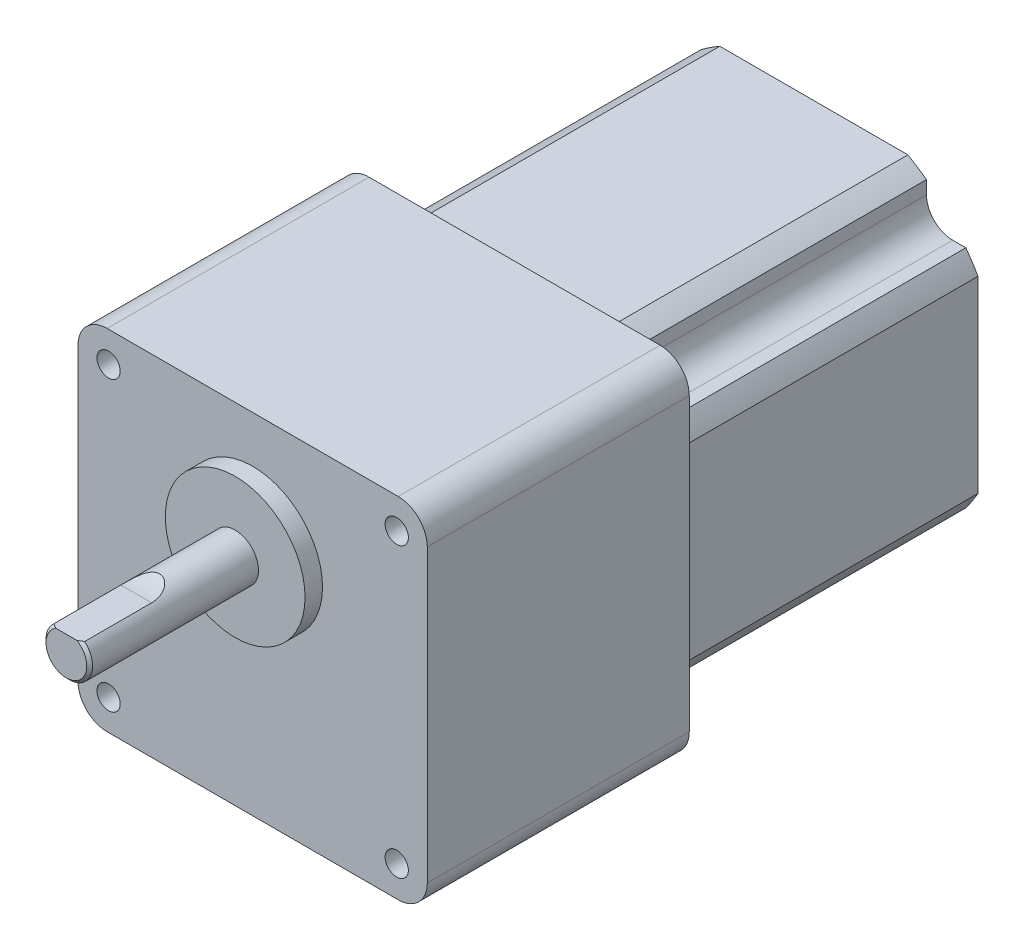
ISO-10303-21;
HEADER;
FILE_DESCRIPTION(('STEP AP214'),'2;1');
FILE_NAME('part.step','',(''),(''),'','','');
FILE_SCHEMA(('AUTOMOTIVE_DESIGN { 1 0 10303 214 1 1 1 1 }'));
ENDSEC;
DATA;
#1=APPLICATION_CONTEXT('core data for automotive mechanical design processes');
#2=APPLICATION_PROTOCOL_DEFINITION('international standard','automotive_design',2000,#1);
#3=PRODUCT_CONTEXT('',#1,'mechanical');
#4=PRODUCT('Part','Part','',(#3));
#5=PRODUCT_RELATED_PRODUCT_CATEGORY('part','',(#4));
#6=PRODUCT_DEFINITION_FORMATION('','',#4);
#7=PRODUCT_DEFINITION_CONTEXT('part definition',#1,'design');
#8=PRODUCT_DEFINITION('design','',#6,#7);
#9=PRODUCT_DEFINITION_SHAPE('','',#8);
#10=(LENGTH_UNIT() NAMED_UNIT(*) SI_UNIT(.MILLI.,.METRE.));
#11=(NAMED_UNIT(*) PLANE_ANGLE_UNIT() SI_UNIT($,.RADIAN.));
#12=(NAMED_UNIT(*) SI_UNIT($,.STERADIAN.) SOLID_ANGLE_UNIT());
#13=UNCERTAINTY_MEASURE_WITH_UNIT(LENGTH_MEASURE(1.E-05),#10,'distance_accuracy_value','');
#14=(GEOMETRIC_REPRESENTATION_CONTEXT(3) GLOBAL_UNCERTAINTY_ASSIGNED_CONTEXT((#13)) GLOBAL_UNIT_ASSIGNED_CONTEXT((#10,
#11,#12)) REPRESENTATION_CONTEXT('',''));
#15=CARTESIAN_POINT('',(0.,0.,0.));
#16=DIRECTION('',(0.,0.,1.));
#17=DIRECTION('',(1.,0.,0.));
#18=AXIS2_PLACEMENT_3D('',#15,#16,#17);
#19=CARTESIAN_POINT('',(0.,0.,3.));
#20=DIRECTION('',(0.,0.,-1.));
#21=DIRECTION('',(-1.,0.,0.));
#22=AXIS2_PLACEMENT_3D('',#19,#20,#21);
#23=CYLINDRICAL_SURFACE('',#22,12.);
#24=CARTESIAN_POINT('',(0.,0.,3.));
#25=DIRECTION('',(0.,0.,1.));
#26=DIRECTION('',(1.,0.,0.));
#27=AXIS2_PLACEMENT_3D('',#24,#25,#26);
#28=CIRCLE('',#27,12.);
#29=CARTESIAN_POINT('',(12.,0.,3.));
#30=VERTEX_POINT('',#29);
#31=EDGE_CURVE('E366',#30,#30,#28,.T.);
#32=ORIENTED_EDGE('',*,*,#31,.F.);
#33=EDGE_LOOP('',(#32));
#34=FACE_BOUND('',#33,.T.);
#35=CARTESIAN_POINT('',(0.,0.,0.));
#36=DIRECTION('',(0.,0.,1.));
#37=DIRECTION('',(1.,0.,0.));
#38=AXIS2_PLACEMENT_3D('',#35,#36,#37);
#39=CIRCLE('',#38,12.);
#40=CARTESIAN_POINT('',(12.,0.,0.));
#41=VERTEX_POINT('',#40);
#42=EDGE_CURVE('E354',#41,#41,#39,.T.);
#43=ORIENTED_EDGE('',*,*,#42,.T.);
#44=EDGE_LOOP('',(#43));
#45=FACE_BOUND('',#44,.T.);
#46=ADVANCED_FACE('F40',(#34,#45),#23,.T.);
#47=CARTESIAN_POINT('',(0.,0.,3.));
#48=DIRECTION('',(0.,0.,1.));
#49=DIRECTION('',(1.,0.,0.));
#50=AXIS2_PLACEMENT_3D('',#47,#48,#49);
#51=PLANE('',#50);
#52=CARTESIAN_POINT('',(0.,0.,3.));
#53=DIRECTION('',(0.,0.,1.));
#54=DIRECTION('',(1.,0.,0.));
#55=AXIS2_PLACEMENT_3D('',#52,#53,#54);
#56=CIRCLE('',#55,4.);
#57=CARTESIAN_POINT('',(4.,0.,3.));
#58=VERTEX_POINT('',#57);
#59=EDGE_CURVE('E367',#58,#58,#56,.T.);
#60=ORIENTED_EDGE('',*,*,#59,.F.);
#61=EDGE_LOOP('',(#60));
#62=FACE_BOUND('',#61,.T.);
#63=ORIENTED_EDGE('',*,*,#31,.T.);
#64=EDGE_LOOP('',(#63));
#65=FACE_BOUND('',#64,.T.);
#66=ADVANCED_FACE('F420',(#62,#65),#51,.T.);
#67=CARTESIAN_POINT('',(0.,0.,32.));
#68=DIRECTION('',(0.,0.,-1.));
#69=DIRECTION('',(-1.,0.,0.));
#70=AXIS2_PLACEMENT_3D('',#67,#68,#69);
#71=CYLINDRICAL_SURFACE('',#70,4.);
#72=CARTESIAN_POINT('',(0.,0.,31.5));
#73=DIRECTION('',(0.,0.,1.));
#74=DIRECTION('',(1.,0.,0.));
#75=AXIS2_PLACEMENT_3D('',#72,#73,#74);
#76=CIRCLE('',#75,4.);
#77=CARTESIAN_POINT('',(2.64575131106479,3.,31.5));
#78=VERTEX_POINT('',#77);
#79=CARTESIAN_POINT('',(-2.6457513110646,3.,31.5));
#80=VERTEX_POINT('',#79);
#81=EDGE_CURVE('E377',#78,#80,#76,.F.);
#82=ORIENTED_EDGE('',*,*,#81,.T.);
#83=DIRECTION('',(0.,0.,-1.));
#84=VECTOR('',#83,1.);
#85=CARTESIAN_POINT('',(-2.64575131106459,3.,32.));
#86=LINE('',#85,#84);
#87=CARTESIAN_POINT('',(-2.64575131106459,3.,20.));
#88=VERTEX_POINT('',#87);
#89=EDGE_CURVE('E363',#80,#88,#86,.T.);
#90=ORIENTED_EDGE('',*,*,#89,.T.);
#91=CARTESIAN_POINT('',(-2.64575131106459,3.,20.));
#92=CARTESIAN_POINT('',(-2.64574586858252,2.99999908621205,19.915243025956));
#93=CARTESIAN_POINT('',(-2.64431426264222,3.00126819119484,19.8304982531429));
#94=CARTESIAN_POINT('',(-2.63855647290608,3.00633339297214,19.6611750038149));
#95=CARTESIAN_POINT('',(-2.63423001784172,3.01012972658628,19.5765965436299));
#96=CARTESIAN_POINT('',(-2.61682033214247,3.02531148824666,19.3229823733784));
#97=CARTESIAN_POINT('',(-2.59930641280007,3.04048959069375,19.1544356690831));
#98=CARTESIAN_POINT('',(-2.55139380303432,3.08080825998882,18.8183944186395));
#99=CARTESIAN_POINT('',(-2.52084927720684,3.1060613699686,18.6509342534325));
#100=CARTESIAN_POINT('',(-2.4454378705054,3.16577982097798,18.3210791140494));
#101=CARTESIAN_POINT('',(-2.40058932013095,3.20023336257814,18.1586779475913));
#102=CARTESIAN_POINT('',(-2.31746041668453,3.26048157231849,17.9097880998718));
#103=CARTESIAN_POINT('',(-2.28469563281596,3.28359802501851,17.8207796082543));
#104=CARTESIAN_POINT('',(-2.2134415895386,3.33204718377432,17.6456877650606));
#105=CARTESIAN_POINT('',(-2.17495257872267,3.35737979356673,17.5596042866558));
#106=CARTESIAN_POINT('',(-2.09194107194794,3.40971844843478,17.391346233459));
#107=CARTESIAN_POINT('',(-2.04744226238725,3.43671770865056,17.3091579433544));
#108=CARTESIAN_POINT('',(-1.95185752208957,3.49188974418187,17.1491508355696));
#109=CARTESIAN_POINT('',(-1.90077328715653,3.52006221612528,17.07133090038));
#110=CARTESIAN_POINT('',(-1.76292503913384,3.59178487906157,16.8814941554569));
#111=CARTESIAN_POINT('',(-1.67148504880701,3.63566248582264,16.7729090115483));
#112=CARTESIAN_POINT('',(-1.47129303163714,3.72116740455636,16.5719254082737));
#113=CARTESIAN_POINT('',(-1.36255778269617,3.7627968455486,16.4795114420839));
#114=CARTESIAN_POINT('',(-1.15089494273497,3.832143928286,16.3312996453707));
#115=CARTESIAN_POINT('',(-1.05089172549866,3.86099619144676,16.2718773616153));
#116=CARTESIAN_POINT('',(-0.841299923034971,3.91200906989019,16.1691127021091));
#117=CARTESIAN_POINT('',(-0.731715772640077,3.93417276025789,16.1257629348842));
#118=CARTESIAN_POINT('',(-0.504833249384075,3.96968368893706,16.0571755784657));
#119=CARTESIAN_POINT('',(-0.387491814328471,3.98297620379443,16.0320503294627));
#120=CARTESIAN_POINT('',(-0.149548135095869,3.99897769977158,16.0018784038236));
#121=CARTESIAN_POINT('',(-0.0289474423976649,4.00169163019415,15.9968223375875));
#122=CARTESIAN_POINT('',(0.198670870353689,3.99651694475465,16.0065371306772));
#123=CARTESIAN_POINT('',(0.305805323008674,3.98969406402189,16.0193148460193));
#124=CARTESIAN_POINT('',(0.516124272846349,3.9679709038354,16.0605742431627));
#125=CARTESIAN_POINT('',(0.619308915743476,3.95307092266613,16.0890553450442));
#126=CARTESIAN_POINT('',(0.820147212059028,3.91636153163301,16.1607236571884));
#127=CARTESIAN_POINT('',(0.917742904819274,3.89449130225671,16.20404057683));
#128=CARTESIAN_POINT('',(1.10470962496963,3.84564343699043,16.3035290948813));
#129=CARTESIAN_POINT('',(1.19407701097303,3.81866355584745,16.3597063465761));
#130=CARTESIAN_POINT('',(1.39900220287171,3.74951515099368,16.5086981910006));
#131=CARTESIAN_POINT('',(1.5099939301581,3.70569653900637,16.6070330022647));
#132=CARTESIAN_POINT('',(1.71340644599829,3.61616731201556,16.8205970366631));
#133=CARTESIAN_POINT('',(1.80579482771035,3.57045355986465,16.9358551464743));
#134=CARTESIAN_POINT('',(1.94750864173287,3.49450021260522,17.1416603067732));
#135=CARTESIAN_POINT('',(2.00136578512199,3.46380103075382,17.2289947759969));
#136=CARTESIAN_POINT('',(2.10130529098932,3.40410185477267,17.4085950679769));
#137=CARTESIAN_POINT('',(2.14738471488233,3.37510250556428,17.5008627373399));
#138=CARTESIAN_POINT('',(2.2325150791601,3.31940851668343,17.6896643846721));
#139=CARTESIAN_POINT('',(2.2715397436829,3.29272267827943,17.7862127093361));
#140=CARTESIAN_POINT('',(2.34297066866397,3.24228257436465,17.98248158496));
#141=CARTESIAN_POINT('',(2.37537507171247,3.21852913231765,18.082203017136));
#142=CARTESIAN_POINT('',(2.44716630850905,3.16452452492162,18.3290385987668));
#143=CARTESIAN_POINT('',(2.48325452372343,3.13607822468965,18.4775161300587));
#144=CARTESIAN_POINT('',(2.54411835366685,3.08690514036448,18.7780872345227));
#145=CARTESIAN_POINT('',(2.5688855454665,3.06618410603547,18.9301834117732));
#146=CARTESIAN_POINT('',(2.60782082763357,3.03313644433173,19.2348677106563));
#147=CARTESIAN_POINT('',(2.62210551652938,3.02071761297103,19.3874308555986));
#148=CARTESIAN_POINT('',(2.63632519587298,3.00829224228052,19.6168979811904));
#149=CARTESIAN_POINT('',(2.63986389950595,3.00518427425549,19.6934407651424));
#150=CARTESIAN_POINT('',(2.64457510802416,3.00103786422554,19.8466527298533));
#151=CARTESIAN_POINT('',(2.64574769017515,2.99999935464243,19.9233219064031));
#152=CARTESIAN_POINT('',(2.6457513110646,3.,20.));
#153=B_SPLINE_CURVE_WITH_KNOTS('',3,(#91,#92,#93,#94,#95,#96,#97,#98,#99,#100,#101,#102,#103,
#104,#105,#106,#107,#108,#109,#110,#111,#112,#113,#114,#115,#116,#117,#118,#119,#120,#121,#122,
#123,#124,#125,#126,#127,#128,#129,#130,#131,#132,#133,#134,#135,#136,#137,#138,#139,#140,#141,
#142,#143,#144,#145,#146,#147,#148,#149,#150,#151,#152),.UNSPECIFIED.,.F.,.F.,(4,2,2,2,2,2,2,2,
2,2,2,2,2,2,2,2,2,2,2,2,2,2,2,2,2,2,2,2,2,2,4),(0.,0.25422445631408,0.508472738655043,
1.01806859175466,1.53352384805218,2.04832118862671,2.34099478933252,2.63365568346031,
2.92519505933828,3.21665951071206,3.66074875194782,4.10440978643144,4.46250594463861,
4.82043721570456,5.18055653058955,5.54050733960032,5.86329486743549,6.18607047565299,
6.51174336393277,6.83755969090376,7.2988867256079,7.76101056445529,8.08190764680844,
8.40292570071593,8.72511581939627,9.04739620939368,9.51292785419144,9.97880529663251,
10.4394187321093,10.6694264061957,10.899426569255),.UNSPECIFIED.);
#154=CARTESIAN_POINT('',(2.6457513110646,3.,20.));
#155=VERTEX_POINT('',#154);
#156=EDGE_CURVE('E389',#88,#155,#153,.T.);
#157=ORIENTED_EDGE('',*,*,#156,.T.);
#158=DIRECTION('',(0.,0.,-1.));
#159=VECTOR('',#158,1.);
#160=CARTESIAN_POINT('',(2.64575131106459,3.,32.));
#161=LINE('',#160,#159);
#162=EDGE_CURVE('E358',#155,#78,#161,.F.);
#163=ORIENTED_EDGE('',*,*,#162,.T.);
#164=EDGE_LOOP('',(#82,#90,#157,#163));
#165=FACE_BOUND('',#164,.T.);
#166=ORIENTED_EDGE('',*,*,#59,.T.);
#167=EDGE_LOOP('',(#166));
#168=FACE_BOUND('',#167,.T.);
#169=ADVANCED_FACE('F415',(#165,#168),#71,.T.);
#170=CARTESIAN_POINT('',(0.,0.,32.));
#171=DIRECTION('',(0.,0.,1.));
#172=DIRECTION('',(1.,0.,0.));
#173=AXIS2_PLACEMENT_3D('',#170,#171,#172);
#174=PLANE('',#173);
#175=DIRECTION('',(1.,0.,0.));
#176=VECTOR('',#175,1.);
#177=CARTESIAN_POINT('',(-5.,3.,32.));
#178=LINE('',#177,#176);
#179=CARTESIAN_POINT('',(-1.80277563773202,3.,32.));
#180=VERTEX_POINT('',#179);
#181=CARTESIAN_POINT('',(1.80277563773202,3.,32.));
#182=VERTEX_POINT('',#181);
#183=EDGE_CURVE('E359',#180,#182,#178,.T.);
#184=ORIENTED_EDGE('',*,*,#183,.F.);
#185=CARTESIAN_POINT('',(0.,0.,32.));
#186=DIRECTION('',(0.,0.,1.));
#187=DIRECTION('',(1.,0.,0.));
#188=AXIS2_PLACEMENT_3D('',#185,#186,#187);
#189=CIRCLE('',#188,3.50000000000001);
#190=EDGE_CURVE('E370',#180,#182,#189,.T.);
#191=ORIENTED_EDGE('',*,*,#190,.T.);
#192=EDGE_LOOP('',(#184,#191));
#193=FACE_BOUND('',#192,.T.);
#194=ADVANCED_FACE('F413',(#193),#174,.T.);
#195=CARTESIAN_POINT('',(0.,0.,32.));
#196=DIRECTION('',(0.,0.,-1.));
#197=DIRECTION('',(-1.,0.,0.));
#198=AXIS2_PLACEMENT_3D('',#195,#196,#197);
#199=CONICAL_SURFACE('',#198,3.50000000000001,0.785398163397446);
#200=CARTESIAN_POINT('',(-8.28302183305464,3.,26.6904341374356));
#201=CARTESIAN_POINT('',(-8.15263782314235,3.,26.8130230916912));
#202=CARTESIAN_POINT('',(-8.02208863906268,3.,26.9354362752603));
#203=CARTESIAN_POINT('',(-7.76060607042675,3.,27.1798531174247));
#204=CARTESIAN_POINT('',(-7.62967268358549,3.,27.3018567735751));
#205=CARTESIAN_POINT('',(-7.23603089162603,3.,27.6673377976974));
#206=CARTESIAN_POINT('',(-6.97266649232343,3.,27.9101103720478));
#207=CARTESIAN_POINT('',(-6.43676879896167,3.,28.3993162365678));
#208=CARTESIAN_POINT('',(-6.1641742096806,3.,28.6456824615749));
#209=CARTESIAN_POINT('',(-5.61571358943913,3.,29.1344175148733));
#210=CARTESIAN_POINT('',(-5.3398497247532,3.,29.3767887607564));
#211=CARTESIAN_POINT('',(-4.92236718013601,3.,29.7359102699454));
#212=CARTESIAN_POINT('',(-4.78263021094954,3.,29.8548466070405));
#213=CARTESIAN_POINT('',(-4.50160854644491,3.,30.0908741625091));
#214=CARTESIAN_POINT('',(-4.36032388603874,3.,30.2079654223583));
#215=CARTESIAN_POINT('',(-4.07554252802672,3.,30.4400375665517));
#216=CARTESIAN_POINT('',(-3.93204187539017,3.,30.5550136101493));
#217=CARTESIAN_POINT('',(-3.64263049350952,3.,30.7818781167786));
#218=CARTESIAN_POINT('',(-3.49671997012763,3.,30.8937668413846));
#219=CARTESIAN_POINT('',(-3.20338019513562,3.,31.1122717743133));
#220=CARTESIAN_POINT('',(-3.05598330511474,3.,31.2189312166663));
#221=CARTESIAN_POINT('',(-2.75726797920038,3.,31.4267949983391));
#222=CARTESIAN_POINT('',(-2.60594795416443,3.,31.527997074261));
#223=CARTESIAN_POINT('',(-2.29890420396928,3.,31.7223206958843));
#224=CARTESIAN_POINT('',(-2.14319772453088,3.,31.8154692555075));
#225=CARTESIAN_POINT('',(-1.82570045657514,3.,31.9906338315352));
#226=CARTESIAN_POINT('',(-1.66391643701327,3.,32.0726617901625));
#227=CARTESIAN_POINT('',(-1.40716113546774,3.,32.187378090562));
#228=CARTESIAN_POINT('',(-1.31471880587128,3.,32.2257102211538));
#229=CARTESIAN_POINT('',(-1.12749448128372,3.,32.2962958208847));
#230=CARTESIAN_POINT('',(-1.03271209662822,3.,32.328548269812));
#231=CARTESIAN_POINT('',(-0.841475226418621,3.,32.3855486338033));
#232=CARTESIAN_POINT('',(-0.745033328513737,3.,32.4103382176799));
#233=CARTESIAN_POINT('',(-0.550338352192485,3.,32.4514219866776));
#234=CARTESIAN_POINT('',(-0.452085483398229,3.,32.4677171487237));
#235=CARTESIAN_POINT('',(-0.253114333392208,3.,32.4909828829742));
#236=CARTESIAN_POINT('',(-0.152380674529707,3.,32.4978246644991));
#237=CARTESIAN_POINT('',(0.0492562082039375,3.,32.5012891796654));
#238=CARTESIAN_POINT('',(0.150159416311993,3.,32.497912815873));
#239=CARTESIAN_POINT('',(0.351467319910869,3.,32.4811545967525));
#240=CARTESIAN_POINT('',(0.451869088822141,3.,32.4677382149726));
#241=CARTESIAN_POINT('',(0.651011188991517,3.,32.4317417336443));
#242=CARTESIAN_POINT('',(0.749751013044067,3.,32.4091588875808));
#243=CARTESIAN_POINT('',(0.980292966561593,3.,32.3464916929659));
#244=CARTESIAN_POINT('',(1.11117205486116,3.,32.3030326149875));
#245=CARTESIAN_POINT('',(1.36855068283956,3.,32.2047393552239));
#246=CARTESIAN_POINT('',(1.49504768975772,3.,32.1498987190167));
#247=CARTESIAN_POINT('',(1.74534487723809,3.,32.0309999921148));
#248=CARTESIAN_POINT('',(1.86909821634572,3.,31.9668444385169));
#249=CARTESIAN_POINT('',(2.05195532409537,3.,31.8657251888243));
#250=CARTESIAN_POINT('',(2.11243803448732,3.,31.8312091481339));
#251=CARTESIAN_POINT('',(2.23256440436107,3.,31.7607515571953));
#252=CARTESIAN_POINT('',(2.29220810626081,3.,31.7248100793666));
#253=CARTESIAN_POINT('',(2.49748813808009,3.,31.598180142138));
#254=CARTESIAN_POINT('',(2.64119894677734,3.,31.5043665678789));
#255=CARTESIAN_POINT('',(2.92497771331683,3.,31.3113605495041));
#256=CARTESIAN_POINT('',(3.06504459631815,3.,31.2121665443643));
#257=CARTESIAN_POINT('',(3.34239530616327,3.,31.0097194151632));
#258=CARTESIAN_POINT('',(3.47967652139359,3.,30.9064627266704));
#259=CARTESIAN_POINT('',(3.75192700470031,3.,30.6969373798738));
#260=CARTESIAN_POINT('',(3.88689609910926,3.,30.5906684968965));
#261=CARTESIAN_POINT('',(4.15551430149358,3.,30.3753709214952));
#262=CARTESIAN_POINT('',(4.28915579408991,3.,30.2663327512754));
#263=CARTESIAN_POINT('',(4.55491091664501,3.,30.0464077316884));
#264=CARTESIAN_POINT('',(4.68702450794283,3.,29.935520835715));
#265=CARTESIAN_POINT('',(5.08134960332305,3.,29.6007890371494));
#266=CARTESIAN_POINT('',(5.34169738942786,3.,29.374749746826));
#267=CARTESIAN_POINT('',(5.82863336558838,3.,28.9455005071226));
#268=CARTESIAN_POINT('',(6.05560219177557,3.,28.7427196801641));
#269=CARTESIAN_POINT('',(6.5075562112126,3.,28.3348901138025));
#270=CARTESIAN_POINT('',(6.73254108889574,3.,28.1298410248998));
#271=CARTESIAN_POINT('',(7.17912974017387,3.,27.719760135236));
#272=CARTESIAN_POINT('',(7.40074610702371,3.,27.5147420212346));
#273=CARTESIAN_POINT('',(7.84273110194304,3.,27.1034510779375));
#274=CARTESIAN_POINT('',(8.06309996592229,3.,26.8971785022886));
#275=CARTESIAN_POINT('',(8.28302183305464,3.,26.6904341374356));
#276=B_SPLINE_CURVE_WITH_KNOTS('',3,(#200,#201,#202,#203,#204,#205,#206,#207,#208,#209,#210,
#211,#212,#213,#214,#215,#216,#217,#218,#219,#220,#221,#222,#223,#224,#225,#226,#227,#228,#229,
#230,#231,#232,#233,#234,#235,#236,#237,#238,#239,#240,#241,#242,#243,#244,#245,#246,#247,#248,
#249,#250,#251,#252,#253,#254,#255,#256,#257,#258,#259,#260,#261,#262,#263,#264,#265,#266,#267,
#268,#269,#270,#271,#272,#273,#274,#275),.UNSPECIFIED.,.F.,.F.,(4,2,2,2,2,2,2,2,2,2,2,2,2,2,2,2,
2,2,2,2,2,2,2,2,2,2,2,2,2,2,2,2,2,2,2,2,2,4),(0.,0.536890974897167,1.07378514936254,
2.14833853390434,3.25060478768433,4.35217750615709,4.90266582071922,5.45314174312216,
6.0047508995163,6.55631317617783,7.10204462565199,7.6480006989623,8.19204801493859,
8.73550637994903,9.03556246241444,9.33566885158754,9.63406712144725,9.93243106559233,
10.2348210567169,10.5371843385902,10.8405922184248,11.1440910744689,11.5570788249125,
11.9703014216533,12.3882094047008,12.5971103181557,12.8060006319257,13.3206701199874,
13.8354897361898,14.350771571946,14.8660919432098,15.3835112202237,15.9009435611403,
16.9352213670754,17.84828587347,18.761493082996,19.6672008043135,20.5727311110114),.UNSPECIFIED.);
#277=EDGE_CURVE('E388',#80,#180,#276,.T.);
#278=ORIENTED_EDGE('',*,*,#277,.F.);
#279=ORIENTED_EDGE('',*,*,#81,.F.);
#280=EDGE_CURVE('E380',#182,#78,#276,.T.);
#281=ORIENTED_EDGE('',*,*,#280,.F.);
#282=ORIENTED_EDGE('',*,*,#190,.F.);
#283=EDGE_LOOP('',(#278,#279,#281,#282));
#284=FACE_BOUND('',#283,.T.);
#285=ADVANCED_FACE('F397',(#284),#199,.T.);
#286=CARTESIAN_POINT('',(-5.,11.5,20.));
#287=DIRECTION('',(1.,0.,0.));
#288=DIRECTION('',(0.,0.,-1.));
#289=AXIS2_PLACEMENT_3D('',#286,#287,#288);
#290=CYLINDRICAL_SURFACE('',#289,8.49999999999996);
#291=DIRECTION('',(1.,0.,0.));
#292=VECTOR('',#291,1.);
#293=CARTESIAN_POINT('',(-5.,3.,20.));
#294=LINE('',#293,#292);
#295=EDGE_CURVE('E355',#88,#155,#294,.T.);
#296=ORIENTED_EDGE('',*,*,#295,.T.);
#297=ORIENTED_EDGE('',*,*,#156,.F.);
#298=EDGE_LOOP('',(#296,#297));
#299=FACE_BOUND('',#298,.T.);
#300=ADVANCED_FACE('F406',(#299),#290,.F.);
#301=CARTESIAN_POINT('',(-5.,3.,0.));
#302=DIRECTION('',(0.,-1.,0.));
#303=DIRECTION('',(0.,0.,-1.));
#304=AXIS2_PLACEMENT_3D('',#301,#302,#303);
#305=PLANE('',#304);
#306=ORIENTED_EDGE('',*,*,#277,.T.);
#307=ORIENTED_EDGE('',*,*,#183,.T.);
#308=ORIENTED_EDGE('',*,*,#280,.T.);
#309=ORIENTED_EDGE('',*,*,#162,.F.);
#310=ORIENTED_EDGE('',*,*,#295,.F.);
#311=ORIENTED_EDGE('',*,*,#89,.F.);
#312=EDGE_LOOP('',(#306,#307,#308,#309,#310,#311));
#313=FACE_BOUND('',#312,.T.);
#314=ADVANCED_FACE('F401',(#313),#305,.F.);
#315=CARTESIAN_POINT('',(-25.,-35.,-45.));
#316=DIRECTION('',(0.,0.,1.));
#317=DIRECTION('',(1.,0.,0.));
#318=AXIS2_PLACEMENT_3D('',#315,#316,#317);
#319=CYLINDRICAL_SURFACE('',#318,5.);
#320=CARTESIAN_POINT('',(-25.,-35.,0.));
#321=DIRECTION('',(0.,0.,-1.));
#322=DIRECTION('',(1.,0.,0.));
#323=AXIS2_PLACEMENT_3D('',#320,#321,#322);
#324=CIRCLE('',#323,5.);
#325=CARTESIAN_POINT('',(-25.,-40.,0.));
#326=VERTEX_POINT('',#325);
#327=CARTESIAN_POINT('',(-30.,-35.,0.));
#328=VERTEX_POINT('',#327);
#329=EDGE_CURVE('E291',#326,#328,#324,.T.);
#330=ORIENTED_EDGE('',*,*,#329,.T.);
#331=DIRECTION('',(0.,0.,1.));
#332=VECTOR('',#331,1.);
#333=CARTESIAN_POINT('',(-30.,-35.,-45.));
#334=LINE('',#333,#332);
#335=CARTESIAN_POINT('',(-30.,-35.,-45.));
#336=VERTEX_POINT('',#335);
#337=EDGE_CURVE('E351',#336,#328,#334,.T.);
#338=ORIENTED_EDGE('',*,*,#337,.F.);
#339=CARTESIAN_POINT('',(-25.,-35.,-45.));
#340=DIRECTION('',(0.,0.,-1.));
#341=DIRECTION('',(1.,0.,0.));
#342=AXIS2_PLACEMENT_3D('',#339,#340,#341);
#343=CIRCLE('',#342,5.);
#344=CARTESIAN_POINT('',(-25.,-40.,-45.));
#345=VERTEX_POINT('',#344);
#346=EDGE_CURVE('E300',#345,#336,#343,.T.);
#347=ORIENTED_EDGE('',*,*,#346,.F.);
#348=DIRECTION('',(0.,0.,1.));
#349=VECTOR('',#348,1.);
#350=CARTESIAN_POINT('',(-25.,-40.,-45.));
#351=LINE('',#350,#349);
#352=EDGE_CURVE('E317',#345,#326,#351,.T.);
#353=ORIENTED_EDGE('',*,*,#352,.T.);
#354=EDGE_LOOP('',(#330,#338,#347,#353));
#355=FACE_BOUND('',#354,.T.);
#356=ADVANCED_FACE('F405',(#355),#319,.T.);
#357=CARTESIAN_POINT('',(-30.,-35.,-45.));
#358=DIRECTION('',(1.,0.,0.));
#359=DIRECTION('',(0.,0.,-1.));
#360=AXIS2_PLACEMENT_3D('',#357,#358,#359);
#361=PLANE('',#360);
#362=DIRECTION('',(0.,1.,0.));
#363=VECTOR('',#362,1.);
#364=CARTESIAN_POINT('',(-30.,-35.,0.));
#365=LINE('',#364,#363);
#366=CARTESIAN_POINT('',(-30.,15.,0.));
#367=VERTEX_POINT('',#366);
#368=EDGE_CURVE('E294',#328,#367,#365,.T.);
#369=ORIENTED_EDGE('',*,*,#368,.T.);
#370=DIRECTION('',(0.,0.,1.));
#371=VECTOR('',#370,1.);
#372=CARTESIAN_POINT('',(-30.,15.,-45.));
#373=LINE('',#372,#371);
#374=CARTESIAN_POINT('',(-30.,15.,-45.));
#375=VERTEX_POINT('',#374);
#376=EDGE_CURVE('E348',#375,#367,#373,.T.);
#377=ORIENTED_EDGE('',*,*,#376,.F.);
#378=DIRECTION('',(0.,1.,0.));
#379=VECTOR('',#378,1.);
#380=CARTESIAN_POINT('',(-30.,-35.,-45.));
#381=LINE('',#380,#379);
#382=EDGE_CURVE('E303',#336,#375,#381,.T.);
#383=ORIENTED_EDGE('',*,*,#382,.F.);
#384=ORIENTED_EDGE('',*,*,#337,.T.);
#385=EDGE_LOOP('',(#369,#377,#383,#384));
#386=FACE_BOUND('',#385,.T.);
#387=ADVANCED_FACE('F474',(#386),#361,.F.);
#388=CARTESIAN_POINT('',(-25.,15.,-45.));
#389=DIRECTION('',(0.,0.,1.));
#390=DIRECTION('',(1.,0.,0.));
#391=AXIS2_PLACEMENT_3D('',#388,#389,#390);
#392=CYLINDRICAL_SURFACE('',#391,5.);
#393=CARTESIAN_POINT('',(-25.,15.,0.));
#394=DIRECTION('',(0.,0.,-1.));
#395=DIRECTION('',(-1.,0.,0.));
#396=AXIS2_PLACEMENT_3D('',#393,#394,#395);
#397=CIRCLE('',#396,5.);
#398=CARTESIAN_POINT('',(-25.,20.,0.));
#399=VERTEX_POINT('',#398);
#400=EDGE_CURVE('E320',#367,#399,#397,.T.);
#401=ORIENTED_EDGE('',*,*,#400,.T.);
#402=DIRECTION('',(0.,0.,1.));
#403=VECTOR('',#402,1.);
#404=CARTESIAN_POINT('',(-25.,20.,-45.));
#405=LINE('',#404,#403);
#406=CARTESIAN_POINT('',(-25.,20.,-45.));
#407=VERTEX_POINT('',#406);
#408=EDGE_CURVE('E345',#407,#399,#405,.T.);
#409=ORIENTED_EDGE('',*,*,#408,.F.);
#410=CARTESIAN_POINT('',(-25.,15.,-45.));
#411=DIRECTION('',(0.,0.,-1.));
#412=DIRECTION('',(-1.,0.,0.));
#413=AXIS2_PLACEMENT_3D('',#410,#411,#412);
#414=CIRCLE('',#413,5.);
#415=EDGE_CURVE('E306',#375,#407,#414,.T.);
#416=ORIENTED_EDGE('',*,*,#415,.F.);
#417=ORIENTED_EDGE('',*,*,#376,.T.);
#418=EDGE_LOOP('',(#401,#409,#416,#417));
#419=FACE_BOUND('',#418,.T.);
#420=ADVANCED_FACE('F470',(#419),#392,.T.);
#421=CARTESIAN_POINT('',(25.,20.,-45.));
#422=DIRECTION('',(0.,-1.,0.));
#423=DIRECTION('',(0.,0.,-1.));
#424=AXIS2_PLACEMENT_3D('',#421,#422,#423);
#425=PLANE('',#424);
#426=DIRECTION('',(1.,0.,0.));
#427=VECTOR('',#426,1.);
#428=CARTESIAN_POINT('',(25.,20.,0.));
#429=LINE('',#428,#427);
#430=CARTESIAN_POINT('',(25.,20.,0.));
#431=VERTEX_POINT('',#430);
#432=EDGE_CURVE('E322',#399,#431,#429,.T.);
#433=ORIENTED_EDGE('',*,*,#432,.T.);
#434=DIRECTION('',(0.,0.,1.));
#435=VECTOR('',#434,1.);
#436=CARTESIAN_POINT('',(25.,20.,-45.));
#437=LINE('',#436,#435);
#438=CARTESIAN_POINT('',(25.,20.,-45.));
#439=VERTEX_POINT('',#438);
#440=EDGE_CURVE('E342',#439,#431,#437,.T.);
#441=ORIENTED_EDGE('',*,*,#440,.F.);
#442=DIRECTION('',(1.,0.,0.));
#443=VECTOR('',#442,1.);
#444=CARTESIAN_POINT('',(25.,20.,-45.));
#445=LINE('',#444,#443);
#446=EDGE_CURVE('E308',#407,#439,#445,.T.);
#447=ORIENTED_EDGE('',*,*,#446,.F.);
#448=ORIENTED_EDGE('',*,*,#408,.T.);
#449=EDGE_LOOP('',(#433,#441,#447,#448));
#450=FACE_BOUND('',#449,.T.);
#451=ADVANCED_FACE('F467',(#450),#425,.F.);
#452=CARTESIAN_POINT('',(25.,15.,-45.));
#453=DIRECTION('',(0.,0.,1.));
#454=DIRECTION('',(1.,0.,0.));
#455=AXIS2_PLACEMENT_3D('',#452,#453,#454);
#456=CYLINDRICAL_SURFACE('',#455,5.);
#457=CARTESIAN_POINT('',(25.,15.,0.));
#458=DIRECTION('',(0.,0.,-1.));
#459=DIRECTION('',(-1.,0.,0.));
#460=AXIS2_PLACEMENT_3D('',#457,#458,#459);
#461=CIRCLE('',#460,5.);
#462=CARTESIAN_POINT('',(30.,15.,0.));
#463=VERTEX_POINT('',#462);
#464=EDGE_CURVE('E324',#431,#463,#461,.T.);
#465=ORIENTED_EDGE('',*,*,#464,.T.);
#466=DIRECTION('',(0.,0.,1.));
#467=VECTOR('',#466,1.);
#468=CARTESIAN_POINT('',(30.,15.,-45.));
#469=LINE('',#468,#467);
#470=CARTESIAN_POINT('',(30.,15.,-45.));
#471=VERTEX_POINT('',#470);
#472=EDGE_CURVE('E339',#471,#463,#469,.T.);
#473=ORIENTED_EDGE('',*,*,#472,.F.);
#474=CARTESIAN_POINT('',(25.,15.,-45.));
#475=DIRECTION('',(0.,0.,-1.));
#476=DIRECTION('',(-1.,0.,0.));
#477=AXIS2_PLACEMENT_3D('',#474,#475,#476);
#478=CIRCLE('',#477,5.);
#479=EDGE_CURVE('E310',#439,#471,#478,.T.);
#480=ORIENTED_EDGE('',*,*,#479,.F.);
#481=ORIENTED_EDGE('',*,*,#440,.T.);
#482=EDGE_LOOP('',(#465,#473,#480,#481));
#483=FACE_BOUND('',#482,.T.);
#484=ADVANCED_FACE('F463',(#483),#456,.T.);
#485=CARTESIAN_POINT('',(30.,-35.,-45.));
#486=DIRECTION('',(-1.,0.,0.));
#487=DIRECTION('',(0.,0.,1.));
#488=AXIS2_PLACEMENT_3D('',#485,#486,#487);
#489=PLANE('',#488);
#490=DIRECTION('',(0.,-1.,0.));
#491=VECTOR('',#490,1.);
#492=CARTESIAN_POINT('',(30.,-35.,0.));
#493=LINE('',#492,#491);
#494=CARTESIAN_POINT('',(30.,-35.,0.));
#495=VERTEX_POINT('',#494);
#496=EDGE_CURVE('E326',#463,#495,#493,.T.);
#497=ORIENTED_EDGE('',*,*,#496,.T.);
#498=DIRECTION('',(0.,0.,1.));
#499=VECTOR('',#498,1.);
#500=CARTESIAN_POINT('',(30.,-35.,-45.));
#501=LINE('',#500,#499);
#502=CARTESIAN_POINT('',(30.,-35.,-45.));
#503=VERTEX_POINT('',#502);
#504=EDGE_CURVE('E336',#503,#495,#501,.T.);
#505=ORIENTED_EDGE('',*,*,#504,.F.);
#506=DIRECTION('',(0.,-1.,0.));
#507=VECTOR('',#506,1.);
#508=CARTESIAN_POINT('',(30.,-35.,-45.));
#509=LINE('',#508,#507);
#510=EDGE_CURVE('E312',#471,#503,#509,.T.);
#511=ORIENTED_EDGE('',*,*,#510,.F.);
#512=ORIENTED_EDGE('',*,*,#472,.T.);
#513=EDGE_LOOP('',(#497,#505,#511,#512));
#514=FACE_BOUND('',#513,.T.);
#515=ADVANCED_FACE('F458',(#514),#489,.F.);
#516=CARTESIAN_POINT('',(25.,-35.,-45.));
#517=DIRECTION('',(0.,0.,1.));
#518=DIRECTION('',(1.,0.,0.));
#519=AXIS2_PLACEMENT_3D('',#516,#517,#518);
#520=CYLINDRICAL_SURFACE('',#519,5.);
#521=CARTESIAN_POINT('',(25.,-35.,0.));
#522=DIRECTION('',(0.,0.,-1.));
#523=DIRECTION('',(1.,0.,0.));
#524=AXIS2_PLACEMENT_3D('',#521,#522,#523);
#525=CIRCLE('',#524,5.);
#526=CARTESIAN_POINT('',(25.,-40.,0.));
#527=VERTEX_POINT('',#526);
#528=EDGE_CURVE('E328',#495,#527,#525,.T.);
#529=ORIENTED_EDGE('',*,*,#528,.T.);
#530=DIRECTION('',(0.,0.,1.));
#531=VECTOR('',#530,1.);
#532=CARTESIAN_POINT('',(25.,-40.,-45.));
#533=LINE('',#532,#531);
#534=CARTESIAN_POINT('',(25.,-40.,-45.));
#535=VERTEX_POINT('',#534);
#536=EDGE_CURVE('E333',#535,#527,#533,.T.);
#537=ORIENTED_EDGE('',*,*,#536,.F.);
#538=CARTESIAN_POINT('',(25.,-35.,-45.));
#539=DIRECTION('',(0.,0.,-1.));
#540=DIRECTION('',(1.,0.,0.));
#541=AXIS2_PLACEMENT_3D('',#538,#539,#540);
#542=CIRCLE('',#541,5.);
#543=EDGE_CURVE('E314',#503,#535,#542,.T.);
#544=ORIENTED_EDGE('',*,*,#543,.F.);
#545=ORIENTED_EDGE('',*,*,#504,.T.);
#546=EDGE_LOOP('',(#529,#537,#544,#545));
#547=FACE_BOUND('',#546,.T.);
#548=ADVANCED_FACE('F452',(#547),#520,.T.);
#549=CARTESIAN_POINT('',(25.,-40.,-45.));
#550=DIRECTION('',(0.,1.,0.));
#551=DIRECTION('',(0.,0.,1.));
#552=AXIS2_PLACEMENT_3D('',#549,#550,#551);
#553=PLANE('',#552);
#554=DIRECTION('',(-1.,0.,0.));
#555=VECTOR('',#554,1.);
#556=CARTESIAN_POINT('',(25.,-40.,0.));
#557=LINE('',#556,#555);
#558=EDGE_CURVE('E304',#527,#326,#557,.T.);
#559=ORIENTED_EDGE('',*,*,#558,.T.);
#560=ORIENTED_EDGE('',*,*,#352,.F.);
#561=DIRECTION('',(-1.,0.,0.));
#562=VECTOR('',#561,1.);
#563=CARTESIAN_POINT('',(25.,-40.,-45.));
#564=LINE('',#563,#562);
#565=EDGE_CURVE('E316',#535,#345,#564,.T.);
#566=ORIENTED_EDGE('',*,*,#565,.F.);
#567=ORIENTED_EDGE('',*,*,#536,.T.);
#568=EDGE_LOOP('',(#559,#560,#566,#567));
#569=FACE_BOUND('',#568,.T.);
#570=ADVANCED_FACE('F448',(#569),#553,.F.);
#571=CARTESIAN_POINT('',(-25.,-35.,-45.));
#572=DIRECTION('',(0.,0.,1.));
#573=DIRECTION('',(1.,0.,0.));
#574=AXIS2_PLACEMENT_3D('',#571,#572,#573);
#575=PLANE('',#574);
#576=DIRECTION('',(0.,-1.,0.));
#577=VECTOR('',#576,1.);
#578=CARTESIAN_POINT('',(19.35,0.,-45.));
#579=LINE('',#578,#577);
#580=CARTESIAN_POINT('',(19.35,-33.85,-45.));
#581=VERTEX_POINT('',#580);
#582=CARTESIAN_POINT('',(19.35,-36.1118268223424,-45.));
#583=VERTEX_POINT('',#582);
#584=EDGE_CURVE('E977',#581,#583,#579,.T.);
#585=ORIENTED_EDGE('',*,*,#584,.F.);
#586=CARTESIAN_POINT('',(23.85,-33.85,-45.));
#587=DIRECTION('',(0.,0.,1.));
#588=DIRECTION('',(1.,0.,0.));
#589=AXIS2_PLACEMENT_3D('',#586,#587,#588);
#590=CIRCLE('',#589,4.5);
#591=CARTESIAN_POINT('',(23.85,-29.35,-45.));
#592=VERTEX_POINT('',#591);
#593=EDGE_CURVE('E1055',#581,#592,#590,.F.);
#594=ORIENTED_EDGE('',*,*,#593,.T.);
#595=DIRECTION('',(1.,0.,0.));
#596=VECTOR('',#595,1.);
#597=CARTESIAN_POINT('',(0.,-29.35,-45.));
#598=LINE('',#597,#596);
#599=CARTESIAN_POINT('',(26.1118268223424,-29.35,-45.));
#600=VERTEX_POINT('',#599);
#601=EDGE_CURVE('E975',#592,#600,#598,.T.);
#602=ORIENTED_EDGE('',*,*,#601,.T.);
#603=CARTESIAN_POINT('',(0.,-10.,-45.));
#604=DIRECTION('',(0.,0.,-1.));
#605=DIRECTION('',(-1.,0.,0.));
#606=AXIS2_PLACEMENT_3D('',#603,#604,#605);
#607=CIRCLE('',#606,32.5);
#608=CARTESIAN_POINT('',(28.2,-26.1558039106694,-45.));
#609=VERTEX_POINT('',#608);
#610=EDGE_CURVE('E973',#609,#600,#607,.T.);
#611=ORIENTED_EDGE('',*,*,#610,.F.);
#612=DIRECTION('',(0.,1.,0.));
#613=VECTOR('',#612,1.);
#614=CARTESIAN_POINT('',(28.2,0.,-45.));
#615=LINE('',#614,#613);
#616=CARTESIAN_POINT('',(28.2,6.15580391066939,-45.));
#617=VERTEX_POINT('',#616);
#618=EDGE_CURVE('E972',#609,#617,#615,.T.);
#619=ORIENTED_EDGE('',*,*,#618,.T.);
#620=CARTESIAN_POINT('',(26.1118268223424,9.35,-45.));
#621=VERTEX_POINT('',#620);
#622=EDGE_CURVE('E970',#621,#617,#607,.T.);
#623=ORIENTED_EDGE('',*,*,#622,.F.);
#624=DIRECTION('',(1.,0.,0.));
#625=VECTOR('',#624,1.);
#626=CARTESIAN_POINT('',(0.,9.35000000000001,-45.));
#627=LINE('',#626,#625);
#628=CARTESIAN_POINT('',(23.85,9.35,-45.));
#629=VERTEX_POINT('',#628);
#630=EDGE_CURVE('E289',#629,#621,#627,.T.);
#631=ORIENTED_EDGE('',*,*,#630,.F.);
#632=CARTESIAN_POINT('',(23.85,13.85,-45.));
#633=DIRECTION('',(0.,0.,1.));
#634=DIRECTION('',(1.,0.,0.));
#635=AXIS2_PLACEMENT_3D('',#632,#633,#634);
#636=CIRCLE('',#635,4.5);
#637=CARTESIAN_POINT('',(19.35,13.85,-45.));
#638=VERTEX_POINT('',#637);
#639=EDGE_CURVE('E1088',#629,#638,#636,.F.);
#640=ORIENTED_EDGE('',*,*,#639,.T.);
#641=DIRECTION('',(0.,-1.,0.));
#642=VECTOR('',#641,1.);
#643=CARTESIAN_POINT('',(19.35,0.,-45.));
#644=LINE('',#643,#642);
#645=CARTESIAN_POINT('',(19.35,16.1118268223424,-45.));
#646=VERTEX_POINT('',#645);
#647=EDGE_CURVE('E274',#646,#638,#644,.T.);
#648=ORIENTED_EDGE('',*,*,#647,.F.);
#649=CARTESIAN_POINT('',(0.,-10.,-45.));
#650=DIRECTION('',(0.,0.,-1.));
#651=DIRECTION('',(-1.,0.,0.));
#652=AXIS2_PLACEMENT_3D('',#649,#650,#651);
#653=CIRCLE('',#652,32.5);
#654=CARTESIAN_POINT('',(16.1558039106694,18.2,-45.));
#655=VERTEX_POINT('',#654);
#656=EDGE_CURVE('E1008',#655,#646,#653,.T.);
#657=ORIENTED_EDGE('',*,*,#656,.F.);
#658=DIRECTION('',(-1.,0.,0.));
#659=VECTOR('',#658,1.);
#660=CARTESIAN_POINT('',(0.,18.2,-45.));
#661=LINE('',#660,#659);
#662=CARTESIAN_POINT('',(-16.1558039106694,18.2,-45.));
#663=VERTEX_POINT('',#662);
#664=EDGE_CURVE('E1007',#655,#663,#661,.T.);
#665=ORIENTED_EDGE('',*,*,#664,.T.);
#666=CARTESIAN_POINT('',(-19.35,16.1118268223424,-45.));
#667=VERTEX_POINT('',#666);
#668=EDGE_CURVE('E1004',#667,#663,#653,.T.);
#669=ORIENTED_EDGE('',*,*,#668,.F.);
#670=DIRECTION('',(0.,-1.,0.));
#671=VECTOR('',#670,1.);
#672=CARTESIAN_POINT('',(-19.35,0.,-45.));
#673=LINE('',#672,#671);
#674=CARTESIAN_POINT('',(-19.35,13.85,-45.));
#675=VERTEX_POINT('',#674);
#676=EDGE_CURVE('E1001',#667,#675,#673,.T.);
#677=ORIENTED_EDGE('',*,*,#676,.T.);
#678=CARTESIAN_POINT('',(-23.85,13.85,-45.));
#679=DIRECTION('',(0.,0.,1.));
#680=DIRECTION('',(1.,0.,0.));
#681=AXIS2_PLACEMENT_3D('',#678,#679,#680);
#682=CIRCLE('',#681,4.5);
#683=CARTESIAN_POINT('',(-23.85,9.35000000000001,-45.));
#684=VERTEX_POINT('',#683);
#685=EDGE_CURVE('E1080',#675,#684,#682,.F.);
#686=ORIENTED_EDGE('',*,*,#685,.T.);
#687=DIRECTION('',(1.,0.,0.));
#688=VECTOR('',#687,1.);
#689=CARTESIAN_POINT('',(0.,9.35000000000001,-45.));
#690=LINE('',#689,#688);
#691=CARTESIAN_POINT('',(-26.1118268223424,9.35000000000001,-45.));
#692=VERTEX_POINT('',#691);
#693=EDGE_CURVE('E998',#692,#684,#690,.T.);
#694=ORIENTED_EDGE('',*,*,#693,.F.);
#695=CARTESIAN_POINT('',(0.,-10.,-45.));
#696=DIRECTION('',(0.,0.,-1.));
#697=DIRECTION('',(-1.,0.,0.));
#698=AXIS2_PLACEMENT_3D('',#695,#696,#697);
#699=CIRCLE('',#698,32.5);
#700=CARTESIAN_POINT('',(-28.2,6.1558039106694,-45.));
#701=VERTEX_POINT('',#700);
#702=EDGE_CURVE('E995',#701,#692,#699,.T.);
#703=ORIENTED_EDGE('',*,*,#702,.F.);
#704=DIRECTION('',(0.,1.,0.));
#705=VECTOR('',#704,1.);
#706=CARTESIAN_POINT('',(-28.2,0.,-45.));
#707=LINE('',#706,#705);
#708=CARTESIAN_POINT('',(-28.2,-26.1558039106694,-45.));
#709=VERTEX_POINT('',#708);
#710=EDGE_CURVE('E994',#709,#701,#707,.T.);
#711=ORIENTED_EDGE('',*,*,#710,.F.);
#712=CARTESIAN_POINT('',(-26.1118268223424,-29.35,-45.));
#713=VERTEX_POINT('',#712);
#714=EDGE_CURVE('E991',#713,#709,#699,.T.);
#715=ORIENTED_EDGE('',*,*,#714,.F.);
#716=DIRECTION('',(1.,0.,0.));
#717=VECTOR('',#716,1.);
#718=CARTESIAN_POINT('',(0.,-29.35,-45.));
#719=LINE('',#718,#717);
#720=CARTESIAN_POINT('',(-23.85,-29.35,-45.));
#721=VERTEX_POINT('',#720);
#722=EDGE_CURVE('E988',#713,#721,#719,.T.);
#723=ORIENTED_EDGE('',*,*,#722,.T.);
#724=CARTESIAN_POINT('',(-23.85,-33.85,-45.));
#725=DIRECTION('',(0.,0.,1.));
#726=DIRECTION('',(1.,0.,0.));
#727=AXIS2_PLACEMENT_3D('',#724,#725,#726);
#728=CIRCLE('',#727,4.5);
#729=CARTESIAN_POINT('',(-19.35,-33.85,-45.));
#730=VERTEX_POINT('',#729);
#731=EDGE_CURVE('E1097',#721,#730,#728,.F.);
#732=ORIENTED_EDGE('',*,*,#731,.T.);
#733=DIRECTION('',(0.,-1.,0.));
#734=VECTOR('',#733,1.);
#735=CARTESIAN_POINT('',(-19.35,0.,-45.));
#736=LINE('',#735,#734);
#737=CARTESIAN_POINT('',(-19.35,-36.1118268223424,-45.));
#738=VERTEX_POINT('',#737);
#739=EDGE_CURVE('E986',#730,#738,#736,.T.);
#740=ORIENTED_EDGE('',*,*,#739,.T.);
#741=CARTESIAN_POINT('',(0.,-10.,-45.));
#742=DIRECTION('',(0.,0.,-1.));
#743=DIRECTION('',(-1.,0.,0.));
#744=AXIS2_PLACEMENT_3D('',#741,#742,#743);
#745=CIRCLE('',#744,32.5);
#746=CARTESIAN_POINT('',(-16.1558039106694,-38.2,-45.));
#747=VERTEX_POINT('',#746);
#748=EDGE_CURVE('E983',#747,#738,#745,.T.);
#749=ORIENTED_EDGE('',*,*,#748,.F.);
#750=DIRECTION('',(-1.,0.,0.));
#751=VECTOR('',#750,1.);
#752=CARTESIAN_POINT('',(0.,-38.2,-45.));
#753=LINE('',#752,#751);
#754=CARTESIAN_POINT('',(16.1558039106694,-38.2,-45.));
#755=VERTEX_POINT('',#754);
#756=EDGE_CURVE('E982',#755,#747,#753,.T.);
#757=ORIENTED_EDGE('',*,*,#756,.F.);
#758=EDGE_CURVE('E979',#583,#755,#745,.T.);
#759=ORIENTED_EDGE('',*,*,#758,.F.);
#760=EDGE_LOOP('',(#585,#594,#602,#611,#619,#623,#631,#640,#648,#657,#665,#669,#677,#686,#694,
#703,#711,#715,#723,#732,#740,#749,#757,#759));
#761=FACE_BOUND('',#760,.T.);
#762=ORIENTED_EDGE('',*,*,#346,.T.);
#763=ORIENTED_EDGE('',*,*,#382,.T.);
#764=ORIENTED_EDGE('',*,*,#415,.T.);
#765=ORIENTED_EDGE('',*,*,#446,.T.);
#766=ORIENTED_EDGE('',*,*,#479,.T.);
#767=ORIENTED_EDGE('',*,*,#510,.T.);
#768=ORIENTED_EDGE('',*,*,#543,.T.);
#769=ORIENTED_EDGE('',*,*,#565,.T.);
#770=EDGE_LOOP('',(#762,#763,#764,#765,#766,#767,#768,#769));
#771=FACE_BOUND('',#770,.T.);
#772=ADVANCED_FACE('F435',(#761,#771),#575,.F.);
#773=CARTESIAN_POINT('',(-25.,-35.,0.));
#774=DIRECTION('',(0.,0.,1.));
#775=DIRECTION('',(1.,0.,0.));
#776=AXIS2_PLACEMENT_3D('',#773,#774,#775);
#777=PLANE('',#776);
#778=CARTESIAN_POINT('',(24.7487373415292,14.7487373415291,0.));
#779=DIRECTION('',(0.,0.,1.));
#780=DIRECTION('',(1.,0.,0.));
#781=AXIS2_PLACEMENT_3D('',#778,#779,#780);
#782=CIRCLE('',#781,2.);
#783=CARTESIAN_POINT('',(26.7487373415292,14.7487373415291,0.));
#784=VERTEX_POINT('',#783);
#785=EDGE_CURVE('E918',#784,#784,#782,.T.);
#786=ORIENTED_EDGE('',*,*,#785,.F.);
#787=EDGE_LOOP('',(#786));
#788=FACE_BOUND('',#787,.T.);
#789=CARTESIAN_POINT('',(24.7487373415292,-34.7487373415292,0.));
#790=DIRECTION('',(0.,0.,1.));
#791=DIRECTION('',(1.,0.,0.));
#792=AXIS2_PLACEMENT_3D('',#789,#790,#791);
#793=CIRCLE('',#792,2.);
#794=CARTESIAN_POINT('',(26.7487373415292,-34.7487373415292,0.));
#795=VERTEX_POINT('',#794);
#796=EDGE_CURVE('E917',#795,#795,#793,.T.);
#797=ORIENTED_EDGE('',*,*,#796,.F.);
#798=EDGE_LOOP('',(#797));
#799=FACE_BOUND('',#798,.T.);
#800=CARTESIAN_POINT('',(-24.7487373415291,-34.7487373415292,0.));
#801=DIRECTION('',(0.,0.,1.));
#802=DIRECTION('',(1.,0.,0.));
#803=AXIS2_PLACEMENT_3D('',#800,#801,#802);
#804=CIRCLE('',#803,2.);
#805=CARTESIAN_POINT('',(-22.7487373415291,-34.7487373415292,0.));
#806=VERTEX_POINT('',#805);
#807=EDGE_CURVE('E1139',#806,#806,#804,.T.);
#808=ORIENTED_EDGE('',*,*,#807,.F.);
#809=EDGE_LOOP('',(#808));
#810=FACE_BOUND('',#809,.T.);
#811=CARTESIAN_POINT('',(-24.7487373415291,14.7487373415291,0.));
#812=DIRECTION('',(0.,0.,1.));
#813=DIRECTION('',(1.,0.,0.));
#814=AXIS2_PLACEMENT_3D('',#811,#812,#813);
#815=CIRCLE('',#814,2.);
#816=CARTESIAN_POINT('',(-22.7487373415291,14.7487373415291,0.));
#817=VERTEX_POINT('',#816);
#818=EDGE_CURVE('E930',#817,#817,#815,.T.);
#819=ORIENTED_EDGE('',*,*,#818,.F.);
#820=EDGE_LOOP('',(#819));
#821=FACE_BOUND('',#820,.T.);
#822=ORIENTED_EDGE('',*,*,#42,.F.);
#823=EDGE_LOOP('',(#822));
#824=FACE_BOUND('',#823,.T.);
#825=ORIENTED_EDGE('',*,*,#329,.F.);
#826=ORIENTED_EDGE('',*,*,#558,.F.);
#827=ORIENTED_EDGE('',*,*,#528,.F.);
#828=ORIENTED_EDGE('',*,*,#496,.F.);
#829=ORIENTED_EDGE('',*,*,#464,.F.);
#830=ORIENTED_EDGE('',*,*,#432,.F.);
#831=ORIENTED_EDGE('',*,*,#400,.F.);
#832=ORIENTED_EDGE('',*,*,#368,.F.);
#833=EDGE_LOOP('',(#825,#826,#827,#828,#829,#830,#831,#832));
#834=FACE_BOUND('',#833,.T.);
#835=ADVANCED_FACE('F432',(#788,#799,#810,#821,#824,#834),#777,.T.);
#836=CARTESIAN_POINT('',(0.,9.35000000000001,-96.4));
#837=DIRECTION('',(0.,-1.,0.));
#838=DIRECTION('',(1.,0.,0.));
#839=AXIS2_PLACEMENT_3D('',#836,#837,#838);
#840=PLANE('',#839);
#841=DIRECTION('',(1.,0.,0.));
#842=VECTOR('',#841,1.);
#843=CARTESIAN_POINT('',(0.,9.35000000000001,-96.4));
#844=LINE('',#843,#842);
#845=CARTESIAN_POINT('',(23.85,9.35,-96.4));
#846=VERTEX_POINT('',#845);
#847=CARTESIAN_POINT('',(26.1118268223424,9.35,-96.4));
#848=VERTEX_POINT('',#847);
#849=EDGE_CURVE('E264',#846,#848,#844,.T.);
#850=ORIENTED_EDGE('',*,*,#849,.F.);
#851=DIRECTION('',(0.,0.,1.));
#852=VECTOR('',#851,1.);
#853=CARTESIAN_POINT('',(23.85,9.35,-45.));
#854=LINE('',#853,#852);
#855=EDGE_CURVE('E1068',#846,#629,#854,.T.);
#856=ORIENTED_EDGE('',*,*,#855,.T.);
#857=ORIENTED_EDGE('',*,*,#630,.T.);
#858=DIRECTION('',(0.,0.,1.));
#859=VECTOR('',#858,1.);
#860=CARTESIAN_POINT('',(26.1118268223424,9.35,-96.4));
#861=LINE('',#860,#859);
#862=EDGE_CURVE('E280',#848,#621,#861,.T.);
#863=ORIENTED_EDGE('',*,*,#862,.F.);
#864=EDGE_LOOP('',(#850,#856,#857,#863));
#865=FACE_BOUND('',#864,.T.);
#866=ADVANCED_FACE('F287',(#865),#840,.F.);
#867=CARTESIAN_POINT('',(0.,-10.,-96.4));
#868=DIRECTION('',(0.,0.,1.));
#869=DIRECTION('',(1.,0.,0.));
#870=AXIS2_PLACEMENT_3D('',#867,#868,#869);
#871=CYLINDRICAL_SURFACE('',#870,32.5);
#872=ORIENTED_EDGE('',*,*,#622,.T.);
#873=DIRECTION('',(0.,0.,1.));
#874=VECTOR('',#873,1.);
#875=CARTESIAN_POINT('',(28.2,6.15580391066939,-96.4));
#876=LINE('',#875,#874);
#877=CARTESIAN_POINT('',(28.2,6.15580391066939,-96.4));
#878=VERTEX_POINT('',#877);
#879=EDGE_CURVE('E282',#878,#617,#876,.T.);
#880=ORIENTED_EDGE('',*,*,#879,.F.);
#881=CARTESIAN_POINT('',(0.,-10.,-96.4));
#882=DIRECTION('',(0.,0.,-1.));
#883=DIRECTION('',(-1.,0.,0.));
#884=AXIS2_PLACEMENT_3D('',#881,#882,#883);
#885=CIRCLE('',#884,32.5);
#886=EDGE_CURVE('E268',#848,#878,#885,.T.);
#887=ORIENTED_EDGE('',*,*,#886,.F.);
#888=ORIENTED_EDGE('',*,*,#862,.T.);
#889=EDGE_LOOP('',(#872,#880,#887,#888));
#890=FACE_BOUND('',#889,.T.);
#891=ADVANCED_FACE('F279',(#890),#871,.T.);
#892=CARTESIAN_POINT('',(28.2,0.,-96.4));
#893=DIRECTION('',(1.,0.,0.));
#894=DIRECTION('',(0.,0.,-1.));
#895=AXIS2_PLACEMENT_3D('',#892,#893,#894);
#896=PLANE('',#895);
#897=ORIENTED_EDGE('',*,*,#618,.F.);
#898=DIRECTION('',(0.,0.,1.));
#899=VECTOR('',#898,1.);
#900=CARTESIAN_POINT('',(28.2,-26.1558039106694,-96.4));
#901=LINE('',#900,#899);
#902=CARTESIAN_POINT('',(28.2,-26.1558039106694,-96.4));
#903=VERTEX_POINT('',#902);
#904=EDGE_CURVE('E296',#903,#609,#901,.T.);
#905=ORIENTED_EDGE('',*,*,#904,.F.);
#906=DIRECTION('',(0.,1.,0.));
#907=VECTOR('',#906,1.);
#908=CARTESIAN_POINT('',(28.2,0.,-96.4));
#909=LINE('',#908,#907);
#910=EDGE_CURVE('E284',#903,#878,#909,.T.);
#911=ORIENTED_EDGE('',*,*,#910,.T.);
#912=ORIENTED_EDGE('',*,*,#879,.T.);
#913=EDGE_LOOP('',(#897,#905,#911,#912));
#914=FACE_BOUND('',#913,.T.);
#915=ADVANCED_FACE('F607',(#914),#896,.T.);
#916=ORIENTED_EDGE('',*,*,#610,.T.);
#917=DIRECTION('',(0.,0.,1.));
#918=VECTOR('',#917,1.);
#919=CARTESIAN_POINT('',(26.1118268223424,-29.35,-96.4));
#920=LINE('',#919,#918);
#921=CARTESIAN_POINT('',(26.1118268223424,-29.35,-96.4));
#922=VERTEX_POINT('',#921);
#923=EDGE_CURVE('E1046',#922,#600,#920,.T.);
#924=ORIENTED_EDGE('',*,*,#923,.F.);
#925=EDGE_CURVE('E286',#903,#922,#885,.T.);
#926=ORIENTED_EDGE('',*,*,#925,.F.);
#927=ORIENTED_EDGE('',*,*,#904,.T.);
#928=EDGE_LOOP('',(#916,#924,#926,#927));
#929=FACE_BOUND('',#928,.T.);
#930=ADVANCED_FACE('F609',(#929),#871,.T.);
#931=CARTESIAN_POINT('',(0.,-29.35,-96.4));
#932=DIRECTION('',(0.,-1.,0.));
#933=DIRECTION('',(1.,0.,0.));
#934=AXIS2_PLACEMENT_3D('',#931,#932,#933);
#935=PLANE('',#934);
#936=ORIENTED_EDGE('',*,*,#601,.F.);
#937=DIRECTION('',(0.,0.,1.));
#938=VECTOR('',#937,1.);
#939=CARTESIAN_POINT('',(23.85,-29.35,-96.4));
#940=LINE('',#939,#938);
#941=CARTESIAN_POINT('',(23.85,-29.35,-96.4));
#942=VERTEX_POINT('',#941);
#943=EDGE_CURVE('E1058',#592,#942,#940,.F.);
#944=ORIENTED_EDGE('',*,*,#943,.T.);
#945=DIRECTION('',(1.,0.,0.));
#946=VECTOR('',#945,1.);
#947=CARTESIAN_POINT('',(0.,-29.35,-96.4));
#948=LINE('',#947,#946);
#949=EDGE_CURVE('E935',#942,#922,#948,.T.);
#950=ORIENTED_EDGE('',*,*,#949,.T.);
#951=ORIENTED_EDGE('',*,*,#923,.T.);
#952=EDGE_LOOP('',(#936,#944,#950,#951));
#953=FACE_BOUND('',#952,.T.);
#954=ADVANCED_FACE('F623',(#953),#935,.T.);
#955=CARTESIAN_POINT('',(19.35,0.,-96.4));
#956=DIRECTION('',(-1.,0.,0.));
#957=DIRECTION('',(0.,-1.,0.));
#958=AXIS2_PLACEMENT_3D('',#955,#956,#957);
#959=PLANE('',#958);
#960=DIRECTION('',(0.,-1.,0.));
#961=VECTOR('',#960,1.);
#962=CARTESIAN_POINT('',(19.35,0.,-96.4));
#963=LINE('',#962,#961);
#964=CARTESIAN_POINT('',(19.35,-33.85,-96.4));
#965=VERTEX_POINT('',#964);
#966=CARTESIAN_POINT('',(19.35,-36.1118268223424,-96.4));
#967=VERTEX_POINT('',#966);
#968=EDGE_CURVE('E937',#965,#967,#963,.T.);
#969=ORIENTED_EDGE('',*,*,#968,.F.);
#970=DIRECTION('',(0.,0.,1.));
#971=VECTOR('',#970,1.);
#972=CARTESIAN_POINT('',(19.35,-33.85,-96.4));
#973=LINE('',#972,#971);
#974=EDGE_CURVE('E1064',#965,#581,#973,.T.);
#975=ORIENTED_EDGE('',*,*,#974,.T.);
#976=ORIENTED_EDGE('',*,*,#584,.T.);
#977=DIRECTION('',(0.,0.,1.));
#978=VECTOR('',#977,1.);
#979=CARTESIAN_POINT('',(19.35,-36.1118268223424,-96.4));
#980=LINE('',#979,#978);
#981=EDGE_CURVE('E1043',#967,#583,#980,.T.);
#982=ORIENTED_EDGE('',*,*,#981,.F.);
#983=EDGE_LOOP('',(#969,#975,#976,#982));
#984=FACE_BOUND('',#983,.T.);
#985=ADVANCED_FACE('F631',(#984),#959,.F.);
#986=CARTESIAN_POINT('',(0.,-10.,-96.4));
#987=DIRECTION('',(0.,0.,1.));
#988=DIRECTION('',(1.,0.,0.));
#989=AXIS2_PLACEMENT_3D('',#986,#987,#988);
#990=CYLINDRICAL_SURFACE('',#989,32.5);
#991=ORIENTED_EDGE('',*,*,#758,.T.);
#992=DIRECTION('',(0.,0.,1.));
#993=VECTOR('',#992,1.);
#994=CARTESIAN_POINT('',(16.1558039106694,-38.2,-96.4));
#995=LINE('',#994,#993);
#996=CARTESIAN_POINT('',(16.1558039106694,-38.2,-96.4));
#997=VERTEX_POINT('',#996);
#998=EDGE_CURVE('E1040',#997,#755,#995,.T.);
#999=ORIENTED_EDGE('',*,*,#998,.F.);
#1000=CARTESIAN_POINT('',(0.,-10.,-96.4));
#1001=DIRECTION('',(0.,0.,-1.));
#1002=DIRECTION('',(-1.,0.,0.));
#1003=AXIS2_PLACEMENT_3D('',#1000,#1001,#1002);
#1004=CIRCLE('',#1003,32.5);
#1005=EDGE_CURVE('E939',#967,#997,#1004,.T.);
#1006=ORIENTED_EDGE('',*,*,#1005,.F.);
#1007=ORIENTED_EDGE('',*,*,#981,.T.);
#1008=EDGE_LOOP('',(#991,#999,#1006,#1007));
#1009=FACE_BOUND('',#1008,.T.);
#1010=ADVANCED_FACE('F640',(#1009),#990,.T.);
#1011=CARTESIAN_POINT('',(0.,-38.2,-96.4));
#1012=DIRECTION('',(0.,1.,0.));
#1013=DIRECTION('',(0.,0.,1.));
#1014=AXIS2_PLACEMENT_3D('',#1011,#1012,#1013);
#1015=PLANE('',#1014);
#1016=ORIENTED_EDGE('',*,*,#756,.T.);
#1017=DIRECTION('',(0.,0.,1.));
#1018=VECTOR('',#1017,1.);
#1019=CARTESIAN_POINT('',(-16.1558039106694,-38.2,-96.4));
#1020=LINE('',#1019,#1018);
#1021=CARTESIAN_POINT('',(-16.1558039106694,-38.2,-96.4));
#1022=VERTEX_POINT('',#1021);
#1023=EDGE_CURVE('E1037',#1022,#747,#1020,.T.);
#1024=ORIENTED_EDGE('',*,*,#1023,.F.);
#1025=DIRECTION('',(-1.,0.,0.));
#1026=VECTOR('',#1025,1.);
#1027=CARTESIAN_POINT('',(0.,-38.2,-96.4));
#1028=LINE('',#1027,#1026);
#1029=EDGE_CURVE('E941',#997,#1022,#1028,.T.);
#1030=ORIENTED_EDGE('',*,*,#1029,.F.);
#1031=ORIENTED_EDGE('',*,*,#998,.T.);
#1032=EDGE_LOOP('',(#1016,#1024,#1030,#1031));
#1033=FACE_BOUND('',#1032,.T.);
#1034=ADVANCED_FACE('F649',(#1033),#1015,.F.);
#1035=ORIENTED_EDGE('',*,*,#748,.T.);
#1036=DIRECTION('',(0.,0.,1.));
#1037=VECTOR('',#1036,1.);
#1038=CARTESIAN_POINT('',(-19.35,-36.1118268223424,-96.4));
#1039=LINE('',#1038,#1037);
#1040=CARTESIAN_POINT('',(-19.35,-36.1118268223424,-96.4));
#1041=VERTEX_POINT('',#1040);
#1042=EDGE_CURVE('E1034',#1041,#738,#1039,.T.);
#1043=ORIENTED_EDGE('',*,*,#1042,.F.);
#1044=EDGE_CURVE('E942',#1022,#1041,#1004,.T.);
#1045=ORIENTED_EDGE('',*,*,#1044,.F.);
#1046=ORIENTED_EDGE('',*,*,#1023,.T.);
#1047=EDGE_LOOP('',(#1035,#1043,#1045,#1046));
#1048=FACE_BOUND('',#1047,.T.);
#1049=ADVANCED_FACE('F652',(#1048),#990,.T.);
#1050=CARTESIAN_POINT('',(-19.35,0.,-96.4));
#1051=DIRECTION('',(-1.,0.,0.));
#1052=DIRECTION('',(0.,-1.,0.));
#1053=AXIS2_PLACEMENT_3D('',#1050,#1051,#1052);
#1054=PLANE('',#1053);
#1055=ORIENTED_EDGE('',*,*,#739,.F.);
#1056=DIRECTION('',(0.,0.,1.));
#1057=VECTOR('',#1056,1.);
#1058=CARTESIAN_POINT('',(-19.35,-33.85,-96.4));
#1059=LINE('',#1058,#1057);
#1060=CARTESIAN_POINT('',(-19.35,-33.85,-96.4));
#1061=VERTEX_POINT('',#1060);
#1062=EDGE_CURVE('E1082',#730,#1061,#1059,.F.);
#1063=ORIENTED_EDGE('',*,*,#1062,.T.);
#1064=DIRECTION('',(0.,-1.,0.));
#1065=VECTOR('',#1064,1.);
#1066=CARTESIAN_POINT('',(-19.35,0.,-96.4));
#1067=LINE('',#1066,#1065);
#1068=EDGE_CURVE('E944',#1061,#1041,#1067,.T.);
#1069=ORIENTED_EDGE('',*,*,#1068,.T.);
#1070=ORIENTED_EDGE('',*,*,#1042,.T.);
#1071=EDGE_LOOP('',(#1055,#1063,#1069,#1070));
#1072=FACE_BOUND('',#1071,.T.);
#1073=ADVANCED_FACE('F667',(#1072),#1054,.T.);
#1074=CARTESIAN_POINT('',(0.,-29.35,-96.4));
#1075=DIRECTION('',(0.,-1.,0.));
#1076=DIRECTION('',(1.,0.,0.));
#1077=AXIS2_PLACEMENT_3D('',#1074,#1075,#1076);
#1078=PLANE('',#1077);
#1079=DIRECTION('',(1.,0.,0.));
#1080=VECTOR('',#1079,1.);
#1081=CARTESIAN_POINT('',(0.,-29.35,-96.4));
#1082=LINE('',#1081,#1080);
#1083=CARTESIAN_POINT('',(-26.1118268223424,-29.35,-96.4));
#1084=VERTEX_POINT('',#1083);
#1085=CARTESIAN_POINT('',(-23.85,-29.35,-96.4));
#1086=VERTEX_POINT('',#1085);
#1087=EDGE_CURVE('E946',#1084,#1086,#1082,.T.);
#1088=ORIENTED_EDGE('',*,*,#1087,.T.);
#1089=DIRECTION('',(0.,0.,1.));
#1090=VECTOR('',#1089,1.);
#1091=CARTESIAN_POINT('',(-23.85,-29.35,-45.));
#1092=LINE('',#1091,#1090);
#1093=EDGE_CURVE('E1085',#1086,#721,#1092,.T.);
#1094=ORIENTED_EDGE('',*,*,#1093,.T.);
#1095=ORIENTED_EDGE('',*,*,#722,.F.);
#1096=DIRECTION('',(0.,0.,1.));
#1097=VECTOR('',#1096,1.);
#1098=CARTESIAN_POINT('',(-26.1118268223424,-29.35,-96.4));
#1099=LINE('',#1098,#1097);
#1100=EDGE_CURVE('E1031',#1084,#713,#1099,.T.);
#1101=ORIENTED_EDGE('',*,*,#1100,.F.);
#1102=EDGE_LOOP('',(#1088,#1094,#1095,#1101));
#1103=FACE_BOUND('',#1102,.T.);
#1104=ADVANCED_FACE('F675',(#1103),#1078,.T.);
#1105=CARTESIAN_POINT('',(0.,-10.,-96.4));
#1106=DIRECTION('',(0.,0.,1.));
#1107=DIRECTION('',(1.,0.,0.));
#1108=AXIS2_PLACEMENT_3D('',#1105,#1106,#1107);
#1109=CYLINDRICAL_SURFACE('',#1108,32.5);
#1110=ORIENTED_EDGE('',*,*,#714,.T.);
#1111=DIRECTION('',(0.,0.,1.));
#1112=VECTOR('',#1111,1.);
#1113=CARTESIAN_POINT('',(-28.2,-26.1558039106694,-96.4));
#1114=LINE('',#1113,#1112);
#1115=CARTESIAN_POINT('',(-28.2,-26.1558039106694,-96.4));
#1116=VERTEX_POINT('',#1115);
#1117=EDGE_CURVE('E1028',#1116,#709,#1114,.T.);
#1118=ORIENTED_EDGE('',*,*,#1117,.F.);
#1119=CARTESIAN_POINT('',(0.,-10.,-96.4));
#1120=DIRECTION('',(0.,0.,-1.));
#1121=DIRECTION('',(-1.,0.,0.));
#1122=AXIS2_PLACEMENT_3D('',#1119,#1120,#1121);
#1123=CIRCLE('',#1122,32.5);
#1124=EDGE_CURVE('E949',#1084,#1116,#1123,.T.);
#1125=ORIENTED_EDGE('',*,*,#1124,.F.);
#1126=ORIENTED_EDGE('',*,*,#1100,.T.);
#1127=EDGE_LOOP('',(#1110,#1118,#1125,#1126));
#1128=FACE_BOUND('',#1127,.T.);
#1129=ADVANCED_FACE('F684',(#1128),#1109,.T.);
#1130=CARTESIAN_POINT('',(-28.2,0.,-96.4));
#1131=DIRECTION('',(1.,0.,0.));
#1132=DIRECTION('',(0.,0.,-1.));
#1133=AXIS2_PLACEMENT_3D('',#1130,#1131,#1132);
#1134=PLANE('',#1133);
#1135=ORIENTED_EDGE('',*,*,#710,.T.);
#1136=DIRECTION('',(0.,0.,1.));
#1137=VECTOR('',#1136,1.);
#1138=CARTESIAN_POINT('',(-28.2,6.1558039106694,-96.4));
#1139=LINE('',#1138,#1137);
#1140=CARTESIAN_POINT('',(-28.2,6.1558039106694,-96.4));
#1141=VERTEX_POINT('',#1140);
#1142=EDGE_CURVE('E1025',#1141,#701,#1139,.T.);
#1143=ORIENTED_EDGE('',*,*,#1142,.F.);
#1144=DIRECTION('',(0.,1.,0.));
#1145=VECTOR('',#1144,1.);
#1146=CARTESIAN_POINT('',(-28.2,0.,-96.4));
#1147=LINE('',#1146,#1145);
#1148=EDGE_CURVE('E951',#1116,#1141,#1147,.T.);
#1149=ORIENTED_EDGE('',*,*,#1148,.F.);
#1150=ORIENTED_EDGE('',*,*,#1117,.T.);
#1151=EDGE_LOOP('',(#1135,#1143,#1149,#1150));
#1152=FACE_BOUND('',#1151,.T.);
#1153=ADVANCED_FACE('F693',(#1152),#1134,.F.);
#1154=ORIENTED_EDGE('',*,*,#702,.T.);
#1155=DIRECTION('',(0.,0.,1.));
#1156=VECTOR('',#1155,1.);
#1157=CARTESIAN_POINT('',(-26.1118268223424,9.35000000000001,-96.4));
#1158=LINE('',#1157,#1156);
#1159=CARTESIAN_POINT('',(-26.1118268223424,9.35000000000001,-96.4));
#1160=VERTEX_POINT('',#1159);
#1161=EDGE_CURVE('E1022',#1160,#692,#1158,.T.);
#1162=ORIENTED_EDGE('',*,*,#1161,.F.);
#1163=EDGE_CURVE('E952',#1141,#1160,#1123,.T.);
#1164=ORIENTED_EDGE('',*,*,#1163,.F.);
#1165=ORIENTED_EDGE('',*,*,#1142,.T.);
#1166=EDGE_LOOP('',(#1154,#1162,#1164,#1165));
#1167=FACE_BOUND('',#1166,.T.);
#1168=ADVANCED_FACE('F696',(#1167),#1109,.T.);
#1169=CARTESIAN_POINT('',(0.,9.35000000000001,-96.4));
#1170=DIRECTION('',(0.,-1.,0.));
#1171=DIRECTION('',(1.,0.,0.));
#1172=AXIS2_PLACEMENT_3D('',#1169,#1170,#1171);
#1173=PLANE('',#1172);
#1174=ORIENTED_EDGE('',*,*,#693,.T.);
#1175=DIRECTION('',(0.,0.,1.));
#1176=VECTOR('',#1175,1.);
#1177=CARTESIAN_POINT('',(-23.85,9.35000000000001,-96.4));
#1178=LINE('',#1177,#1176);
#1179=CARTESIAN_POINT('',(-23.85,9.35000000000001,-96.4));
#1180=VERTEX_POINT('',#1179);
#1181=EDGE_CURVE('E1081',#684,#1180,#1178,.F.);
#1182=ORIENTED_EDGE('',*,*,#1181,.T.);
#1183=DIRECTION('',(1.,0.,0.));
#1184=VECTOR('',#1183,1.);
#1185=CARTESIAN_POINT('',(0.,9.35000000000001,-96.4));
#1186=LINE('',#1185,#1184);
#1187=EDGE_CURVE('E954',#1160,#1180,#1186,.T.);
#1188=ORIENTED_EDGE('',*,*,#1187,.F.);
#1189=ORIENTED_EDGE('',*,*,#1161,.T.);
#1190=EDGE_LOOP('',(#1174,#1182,#1188,#1189));
#1191=FACE_BOUND('',#1190,.T.);
#1192=ADVANCED_FACE('F711',(#1191),#1173,.F.);
#1193=CARTESIAN_POINT('',(-19.35,0.,-96.4));
#1194=DIRECTION('',(-1.,0.,0.));
#1195=DIRECTION('',(0.,-1.,0.));
#1196=AXIS2_PLACEMENT_3D('',#1193,#1194,#1195);
#1197=PLANE('',#1196);
#1198=DIRECTION('',(0.,-1.,0.));
#1199=VECTOR('',#1198,1.);
#1200=CARTESIAN_POINT('',(-19.35,0.,-96.4));
#1201=LINE('',#1200,#1199);
#1202=CARTESIAN_POINT('',(-19.35,16.1118268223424,-96.4));
#1203=VERTEX_POINT('',#1202);
#1204=CARTESIAN_POINT('',(-19.35,13.85,-96.4));
#1205=VERTEX_POINT('',#1204);
#1206=EDGE_CURVE('E957',#1203,#1205,#1201,.T.);
#1207=ORIENTED_EDGE('',*,*,#1206,.T.);
#1208=DIRECTION('',(0.,0.,1.));
#1209=VECTOR('',#1208,1.);
#1210=CARTESIAN_POINT('',(-19.35,13.85,-96.4));
#1211=LINE('',#1210,#1209);
#1212=EDGE_CURVE('E1078',#1205,#675,#1211,.T.);
#1213=ORIENTED_EDGE('',*,*,#1212,.T.);
#1214=ORIENTED_EDGE('',*,*,#676,.F.);
#1215=DIRECTION('',(0.,0.,1.));
#1216=VECTOR('',#1215,1.);
#1217=CARTESIAN_POINT('',(-19.35,16.1118268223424,-96.4));
#1218=LINE('',#1217,#1216);
#1219=EDGE_CURVE('E1019',#1203,#667,#1218,.T.);
#1220=ORIENTED_EDGE('',*,*,#1219,.F.);
#1221=EDGE_LOOP('',(#1207,#1213,#1214,#1220));
#1222=FACE_BOUND('',#1221,.T.);
#1223=ADVANCED_FACE('F719',(#1222),#1197,.T.);
#1224=CARTESIAN_POINT('',(0.,-10.,-96.4));
#1225=DIRECTION('',(0.,0.,1.));
#1226=DIRECTION('',(1.,0.,0.));
#1227=AXIS2_PLACEMENT_3D('',#1224,#1225,#1226);
#1228=CYLINDRICAL_SURFACE('',#1227,32.5);
#1229=ORIENTED_EDGE('',*,*,#668,.T.);
#1230=DIRECTION('',(0.,0.,1.));
#1231=VECTOR('',#1230,1.);
#1232=CARTESIAN_POINT('',(-16.1558039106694,18.2,-96.4));
#1233=LINE('',#1232,#1231);
#1234=CARTESIAN_POINT('',(-16.1558039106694,18.2,-96.4));
#1235=VERTEX_POINT('',#1234);
#1236=EDGE_CURVE('E1016',#1235,#663,#1233,.T.);
#1237=ORIENTED_EDGE('',*,*,#1236,.F.);
#1238=CARTESIAN_POINT('',(0.,-10.,-96.4));
#1239=DIRECTION('',(0.,0.,-1.));
#1240=DIRECTION('',(-1.,0.,0.));
#1241=AXIS2_PLACEMENT_3D('',#1238,#1239,#1240);
#1242=CIRCLE('',#1241,32.5);
#1243=EDGE_CURVE('E960',#1203,#1235,#1242,.T.);
#1244=ORIENTED_EDGE('',*,*,#1243,.F.);
#1245=ORIENTED_EDGE('',*,*,#1219,.T.);
#1246=EDGE_LOOP('',(#1229,#1237,#1244,#1245));
#1247=FACE_BOUND('',#1246,.T.);
#1248=ADVANCED_FACE('F728',(#1247),#1228,.T.);
#1249=CARTESIAN_POINT('',(0.,18.2,-96.4));
#1250=DIRECTION('',(0.,1.,0.));
#1251=DIRECTION('',(0.,0.,1.));
#1252=AXIS2_PLACEMENT_3D('',#1249,#1250,#1251);
#1253=PLANE('',#1252);
#1254=ORIENTED_EDGE('',*,*,#664,.F.);
#1255=DIRECTION('',(0.,0.,1.));
#1256=VECTOR('',#1255,1.);
#1257=CARTESIAN_POINT('',(16.1558039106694,18.2,-96.4));
#1258=LINE('',#1257,#1256);
#1259=CARTESIAN_POINT('',(16.1558039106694,18.2,-96.4));
#1260=VERTEX_POINT('',#1259);
#1261=EDGE_CURVE('E1013',#1260,#655,#1258,.T.);
#1262=ORIENTED_EDGE('',*,*,#1261,.F.);
#1263=DIRECTION('',(-1.,0.,0.));
#1264=VECTOR('',#1263,1.);
#1265=CARTESIAN_POINT('',(0.,18.2,-96.4));
#1266=LINE('',#1265,#1264);
#1267=EDGE_CURVE('E962',#1260,#1235,#1266,.T.);
#1268=ORIENTED_EDGE('',*,*,#1267,.T.);
#1269=ORIENTED_EDGE('',*,*,#1236,.T.);
#1270=EDGE_LOOP('',(#1254,#1262,#1268,#1269));
#1271=FACE_BOUND('',#1270,.T.);
#1272=ADVANCED_FACE('F737',(#1271),#1253,.T.);
#1273=ORIENTED_EDGE('',*,*,#656,.T.);
#1274=DIRECTION('',(0.,0.,1.));
#1275=VECTOR('',#1274,1.);
#1276=CARTESIAN_POINT('',(19.35,16.1118268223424,-96.4));
#1277=LINE('',#1276,#1275);
#1278=CARTESIAN_POINT('',(19.35,16.1118268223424,-96.4));
#1279=VERTEX_POINT('',#1278);
#1280=EDGE_CURVE('E968',#1279,#646,#1277,.T.);
#1281=ORIENTED_EDGE('',*,*,#1280,.F.);
#1282=EDGE_CURVE('E963',#1260,#1279,#1242,.T.);
#1283=ORIENTED_EDGE('',*,*,#1282,.F.);
#1284=ORIENTED_EDGE('',*,*,#1261,.T.);
#1285=EDGE_LOOP('',(#1273,#1281,#1283,#1284));
#1286=FACE_BOUND('',#1285,.T.);
#1287=ADVANCED_FACE('F740',(#1286),#1228,.T.);
#1288=CARTESIAN_POINT('',(19.35,0.,-96.4));
#1289=DIRECTION('',(-1.,0.,0.));
#1290=DIRECTION('',(0.,-1.,0.));
#1291=AXIS2_PLACEMENT_3D('',#1288,#1289,#1290);
#1292=PLANE('',#1291);
#1293=ORIENTED_EDGE('',*,*,#647,.T.);
#1294=DIRECTION('',(0.,0.,1.));
#1295=VECTOR('',#1294,1.);
#1296=CARTESIAN_POINT('',(19.35,13.85,-96.4));
#1297=LINE('',#1296,#1295);
#1298=CARTESIAN_POINT('',(19.35,13.85,-96.4));
#1299=VERTEX_POINT('',#1298);
#1300=EDGE_CURVE('E55',#638,#1299,#1297,.F.);
#1301=ORIENTED_EDGE('',*,*,#1300,.T.);
#1302=DIRECTION('',(0.,-1.,0.));
#1303=VECTOR('',#1302,1.);
#1304=CARTESIAN_POINT('',(19.35,0.,-96.4));
#1305=LINE('',#1304,#1303);
#1306=EDGE_CURVE('E966',#1279,#1299,#1305,.T.);
#1307=ORIENTED_EDGE('',*,*,#1306,.F.);
#1308=ORIENTED_EDGE('',*,*,#1280,.T.);
#1309=EDGE_LOOP('',(#1293,#1301,#1307,#1308));
#1310=FACE_BOUND('',#1309,.T.);
#1311=ADVANCED_FACE('F754',(#1310),#1292,.F.);
#1312=CARTESIAN_POINT('',(0.,0.,-96.4));
#1313=DIRECTION('',(0.,0.,-1.));
#1314=DIRECTION('',(-1.,0.,0.));
#1315=AXIS2_PLACEMENT_3D('',#1312,#1313,#1314);
#1316=PLANE('',#1315);
#1317=ORIENTED_EDGE('',*,*,#1306,.T.);
#1318=CARTESIAN_POINT('',(23.85,13.85,-96.4));
#1319=DIRECTION('',(0.,0.,-1.));
#1320=DIRECTION('',(-1.,0.,0.));
#1321=AXIS2_PLACEMENT_3D('',#1318,#1319,#1320);
#1322=CIRCLE('',#1321,4.5);
#1323=EDGE_CURVE('E12',#1299,#846,#1322,.F.);
#1324=ORIENTED_EDGE('',*,*,#1323,.T.);
#1325=ORIENTED_EDGE('',*,*,#849,.T.);
#1326=ORIENTED_EDGE('',*,*,#886,.T.);
#1327=ORIENTED_EDGE('',*,*,#910,.F.);
#1328=ORIENTED_EDGE('',*,*,#925,.T.);
#1329=ORIENTED_EDGE('',*,*,#949,.F.);
#1330=CARTESIAN_POINT('',(23.85,-33.85,-96.4));
#1331=DIRECTION('',(0.,0.,-1.));
#1332=DIRECTION('',(-1.,0.,0.));
#1333=AXIS2_PLACEMENT_3D('',#1330,#1331,#1332);
#1334=CIRCLE('',#1333,4.5);
#1335=EDGE_CURVE('E1060',#942,#965,#1334,.F.);
#1336=ORIENTED_EDGE('',*,*,#1335,.T.);
#1337=ORIENTED_EDGE('',*,*,#968,.T.);
#1338=ORIENTED_EDGE('',*,*,#1005,.T.);
#1339=ORIENTED_EDGE('',*,*,#1029,.T.);
#1340=ORIENTED_EDGE('',*,*,#1044,.T.);
#1341=ORIENTED_EDGE('',*,*,#1068,.F.);
#1342=CARTESIAN_POINT('',(-23.85,-33.85,-96.4));
#1343=DIRECTION('',(0.,0.,-1.));
#1344=DIRECTION('',(-1.,0.,0.));
#1345=AXIS2_PLACEMENT_3D('',#1342,#1343,#1344);
#1346=CIRCLE('',#1345,4.5);
#1347=EDGE_CURVE('E1065',#1061,#1086,#1346,.F.);
#1348=ORIENTED_EDGE('',*,*,#1347,.T.);
#1349=ORIENTED_EDGE('',*,*,#1087,.F.);
#1350=ORIENTED_EDGE('',*,*,#1124,.T.);
#1351=ORIENTED_EDGE('',*,*,#1148,.T.);
#1352=ORIENTED_EDGE('',*,*,#1163,.T.);
#1353=ORIENTED_EDGE('',*,*,#1187,.T.);
#1354=CARTESIAN_POINT('',(-23.85,13.85,-96.4));
#1355=DIRECTION('',(0.,0.,-1.));
#1356=DIRECTION('',(-1.,0.,0.));
#1357=AXIS2_PLACEMENT_3D('',#1354,#1355,#1356);
#1358=CIRCLE('',#1357,4.5);
#1359=EDGE_CURVE('E48',#1180,#1205,#1358,.F.);
#1360=ORIENTED_EDGE('',*,*,#1359,.T.);
#1361=ORIENTED_EDGE('',*,*,#1206,.F.);
#1362=ORIENTED_EDGE('',*,*,#1243,.T.);
#1363=ORIENTED_EDGE('',*,*,#1267,.F.);
#1364=ORIENTED_EDGE('',*,*,#1282,.T.);
#1365=EDGE_LOOP('',(#1317,#1324,#1325,#1326,#1327,#1328,#1329,#1336,#1337,#1338,#1339,#1340,
#1341,#1348,#1349,#1350,#1351,#1352,#1353,#1360,#1361,#1362,#1363,#1364));
#1366=FACE_BOUND('',#1365,.T.);
#1367=ADVANCED_FACE('F266',(#1366),#1316,.T.);
#1368=CARTESIAN_POINT('',(23.85,-33.85,-96.4));
#1369=DIRECTION('',(0.,0.,1.));
#1370=DIRECTION('',(1.,0.,0.));
#1371=AXIS2_PLACEMENT_3D('',#1368,#1369,#1370);
#1372=CYLINDRICAL_SURFACE('',#1371,4.5);
#1373=ORIENTED_EDGE('',*,*,#1335,.F.);
#1374=ORIENTED_EDGE('',*,*,#943,.F.);
#1375=ORIENTED_EDGE('',*,*,#593,.F.);
#1376=ORIENTED_EDGE('',*,*,#974,.F.);
#1377=EDGE_LOOP('',(#1373,#1374,#1375,#1376));
#1378=FACE_BOUND('',#1377,.T.);
#1379=ADVANCED_FACE('F768',(#1378),#1372,.F.);
#1380=CARTESIAN_POINT('',(-23.85,-33.85,-96.4));
#1381=DIRECTION('',(0.,0.,-1.));
#1382=DIRECTION('',(-1.,0.,0.));
#1383=AXIS2_PLACEMENT_3D('',#1380,#1381,#1382);
#1384=CYLINDRICAL_SURFACE('',#1383,4.5);
#1385=ORIENTED_EDGE('',*,*,#1347,.F.);
#1386=ORIENTED_EDGE('',*,*,#1062,.F.);
#1387=ORIENTED_EDGE('',*,*,#731,.F.);
#1388=ORIENTED_EDGE('',*,*,#1093,.F.);
#1389=EDGE_LOOP('',(#1385,#1386,#1387,#1388));
#1390=FACE_BOUND('',#1389,.T.);
#1391=ADVANCED_FACE('F785',(#1390),#1384,.F.);
#1392=CARTESIAN_POINT('',(-23.85,13.85,-96.4));
#1393=DIRECTION('',(0.,0.,1.));
#1394=DIRECTION('',(1.,0.,0.));
#1395=AXIS2_PLACEMENT_3D('',#1392,#1393,#1394);
#1396=CYLINDRICAL_SURFACE('',#1395,4.5);
#1397=ORIENTED_EDGE('',*,*,#1359,.F.);
#1398=ORIENTED_EDGE('',*,*,#1181,.F.);
#1399=ORIENTED_EDGE('',*,*,#685,.F.);
#1400=ORIENTED_EDGE('',*,*,#1212,.F.);
#1401=EDGE_LOOP('',(#1397,#1398,#1399,#1400));
#1402=FACE_BOUND('',#1401,.T.);
#1403=ADVANCED_FACE('F793',(#1402),#1396,.F.);
#1404=CARTESIAN_POINT('',(23.85,13.85,-96.4));
#1405=DIRECTION('',(0.,0.,-1.));
#1406=DIRECTION('',(-1.,0.,0.));
#1407=AXIS2_PLACEMENT_3D('',#1404,#1405,#1406);
#1408=CYLINDRICAL_SURFACE('',#1407,4.5);
#1409=ORIENTED_EDGE('',*,*,#1323,.F.);
#1410=ORIENTED_EDGE('',*,*,#1300,.F.);
#1411=ORIENTED_EDGE('',*,*,#639,.F.);
#1412=ORIENTED_EDGE('',*,*,#855,.F.);
#1413=EDGE_LOOP('',(#1409,#1410,#1411,#1412));
#1414=FACE_BOUND('',#1413,.T.);
#1415=ADVANCED_FACE('F42',(#1414),#1408,.F.);
#1416=CARTESIAN_POINT('',(-24.7487373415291,14.7487373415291,-8.));
#1417=DIRECTION('',(0.,0.,1.));
#1418=DIRECTION('',(1.,0.,0.));
#1419=AXIS2_PLACEMENT_3D('',#1416,#1417,#1418);
#1420=CYLINDRICAL_SURFACE('',#1419,2.);
#1421=CARTESIAN_POINT('',(-24.7487373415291,14.7487373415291,-8.));
#1422=DIRECTION('',(0.,0.,1.));
#1423=DIRECTION('',(1.,0.,0.));
#1424=AXIS2_PLACEMENT_3D('',#1421,#1422,#1423);
#1425=CIRCLE('',#1424,2.);
#1426=CARTESIAN_POINT('',(-22.7487373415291,14.7487373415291,-8.));
#1427=VERTEX_POINT('',#1426);
#1428=EDGE_CURVE('E927',#1427,#1427,#1425,.T.);
#1429=ORIENTED_EDGE('',*,*,#1428,.F.);
#1430=EDGE_LOOP('',(#1429));
#1431=FACE_BOUND('',#1430,.T.);
#1432=ORIENTED_EDGE('',*,*,#818,.T.);
#1433=EDGE_LOOP('',(#1432));
#1434=FACE_BOUND('',#1433,.T.);
#1435=ADVANCED_FACE('F808',(#1431,#1434),#1420,.F.);
#1436=CARTESIAN_POINT('',(-24.7487373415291,14.7487373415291,-8.));
#1437=DIRECTION('',(0.,0.,1.));
#1438=DIRECTION('',(1.,0.,0.));
#1439=AXIS2_PLACEMENT_3D('',#1436,#1437,#1438);
#1440=PLANE('',#1439);
#1441=ORIENTED_EDGE('',*,*,#1428,.T.);
#1442=EDGE_LOOP('',(#1441));
#1443=FACE_BOUND('',#1442,.T.);
#1444=ADVANCED_FACE('F815',(#1443),#1440,.T.);
#1445=CARTESIAN_POINT('',(-24.7487373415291,-34.7487373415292,-8.));
#1446=DIRECTION('',(0.,0.,1.));
#1447=DIRECTION('',(1.,0.,0.));
#1448=AXIS2_PLACEMENT_3D('',#1445,#1446,#1447);
#1449=CYLINDRICAL_SURFACE('',#1448,2.);
#1450=CARTESIAN_POINT('',(-24.7487373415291,-34.7487373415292,-8.));
#1451=DIRECTION('',(0.,0.,1.));
#1452=DIRECTION('',(1.,0.,0.));
#1453=AXIS2_PLACEMENT_3D('',#1450,#1451,#1452);
#1454=CIRCLE('',#1453,2.);
#1455=CARTESIAN_POINT('',(-22.7487373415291,-34.7487373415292,-8.));
#1456=VERTEX_POINT('',#1455);
#1457=EDGE_CURVE('E932',#1456,#1456,#1454,.T.);
#1458=ORIENTED_EDGE('',*,*,#1457,.F.);
#1459=EDGE_LOOP('',(#1458));
#1460=FACE_BOUND('',#1459,.T.);
#1461=ORIENTED_EDGE('',*,*,#807,.T.);
#1462=EDGE_LOOP('',(#1461));
#1463=FACE_BOUND('',#1462,.T.);
#1464=ADVANCED_FACE('F824',(#1460,#1463),#1449,.F.);
#1465=CARTESIAN_POINT('',(-24.7487373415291,-34.7487373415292,-8.));
#1466=DIRECTION('',(0.,0.,1.));
#1467=DIRECTION('',(1.,0.,0.));
#1468=AXIS2_PLACEMENT_3D('',#1465,#1466,#1467);
#1469=PLANE('',#1468);
#1470=ORIENTED_EDGE('',*,*,#1457,.T.);
#1471=EDGE_LOOP('',(#1470));
#1472=FACE_BOUND('',#1471,.T.);
#1473=ADVANCED_FACE('F833',(#1472),#1469,.T.);
#1474=CARTESIAN_POINT('',(24.7487373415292,-34.7487373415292,-8.));
#1475=DIRECTION('',(0.,0.,1.));
#1476=DIRECTION('',(1.,0.,0.));
#1477=AXIS2_PLACEMENT_3D('',#1474,#1475,#1476);
#1478=CYLINDRICAL_SURFACE('',#1477,2.);
#1479=CARTESIAN_POINT('',(24.7487373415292,-34.7487373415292,-8.));
#1480=DIRECTION('',(0.,0.,1.));
#1481=DIRECTION('',(1.,0.,0.));
#1482=AXIS2_PLACEMENT_3D('',#1479,#1480,#1481);
#1483=CIRCLE('',#1482,2.);
#1484=CARTESIAN_POINT('',(26.7487373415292,-34.7487373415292,-8.));
#1485=VERTEX_POINT('',#1484);
#1486=EDGE_CURVE('E921',#1485,#1485,#1483,.T.);
#1487=ORIENTED_EDGE('',*,*,#1486,.F.);
#1488=EDGE_LOOP('',(#1487));
#1489=FACE_BOUND('',#1488,.T.);
#1490=ORIENTED_EDGE('',*,*,#796,.T.);
#1491=EDGE_LOOP('',(#1490));
#1492=FACE_BOUND('',#1491,.T.);
#1493=ADVANCED_FACE('F842',(#1489,#1492),#1478,.F.);
#1494=CARTESIAN_POINT('',(24.7487373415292,-34.7487373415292,-8.));
#1495=DIRECTION('',(0.,0.,1.));
#1496=DIRECTION('',(1.,0.,0.));
#1497=AXIS2_PLACEMENT_3D('',#1494,#1495,#1496);
#1498=PLANE('',#1497);
#1499=ORIENTED_EDGE('',*,*,#1486,.T.);
#1500=EDGE_LOOP('',(#1499));
#1501=FACE_BOUND('',#1500,.T.);
#1502=ADVANCED_FACE('F851',(#1501),#1498,.T.);
#1503=CARTESIAN_POINT('',(24.7487373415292,14.7487373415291,-8.));
#1504=DIRECTION('',(0.,0.,1.));
#1505=DIRECTION('',(1.,0.,0.));
#1506=AXIS2_PLACEMENT_3D('',#1503,#1504,#1505);
#1507=CYLINDRICAL_SURFACE('',#1506,2.);
#1508=CARTESIAN_POINT('',(24.7487373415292,14.7487373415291,-8.));
#1509=DIRECTION('',(0.,0.,1.));
#1510=DIRECTION('',(1.,0.,0.));
#1511=AXIS2_PLACEMENT_3D('',#1508,#1509,#1510);
#1512=CIRCLE('',#1511,2.);
#1513=CARTESIAN_POINT('',(26.7487373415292,14.7487373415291,-8.));
#1514=VERTEX_POINT('',#1513);
#1515=EDGE_CURVE('E916',#1514,#1514,#1512,.T.);
#1516=ORIENTED_EDGE('',*,*,#1515,.F.);
#1517=EDGE_LOOP('',(#1516));
#1518=FACE_BOUND('',#1517,.T.);
#1519=ORIENTED_EDGE('',*,*,#785,.T.);
#1520=EDGE_LOOP('',(#1519));
#1521=FACE_BOUND('',#1520,.T.);
#1522=ADVANCED_FACE('F860',(#1518,#1521),#1507,.F.);
#1523=CARTESIAN_POINT('',(24.7487373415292,14.7487373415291,-8.));
#1524=DIRECTION('',(0.,0.,1.));
#1525=DIRECTION('',(1.,0.,0.));
#1526=AXIS2_PLACEMENT_3D('',#1523,#1524,#1525);
#1527=PLANE('',#1526);
#1528=ORIENTED_EDGE('',*,*,#1515,.T.);
#1529=EDGE_LOOP('',(#1528));
#1530=FACE_BOUND('',#1529,.T.);
#1531=ADVANCED_FACE('F869',(#1530),#1527,.T.);
#1532=CLOSED_SHELL('',(#46,#66,#169,#194,#285,#300,#314,#356,#387,#420,#451,#484,#515,#548,#570,
#772,#835,#866,#891,#915,#930,#954,#985,#1010,#1034,#1049,#1073,#1104,#1129,#1153,#1168,#1192,
#1223,#1248,#1272,#1287,#1311,#1367,#1379,#1391,#1403,#1415,#1435,#1444,#1464,#1473,#1493,#1502,
#1522,#1531));
#1533=MANIFOLD_SOLID_BREP('B2',#1532);
#1534=ADVANCED_BREP_SHAPE_REPRESENTATION('',(#18,#1533),#14);
#1535=SHAPE_DEFINITION_REPRESENTATION(#9,#1534);
ENDSEC;
END-ISO-10303-21;
